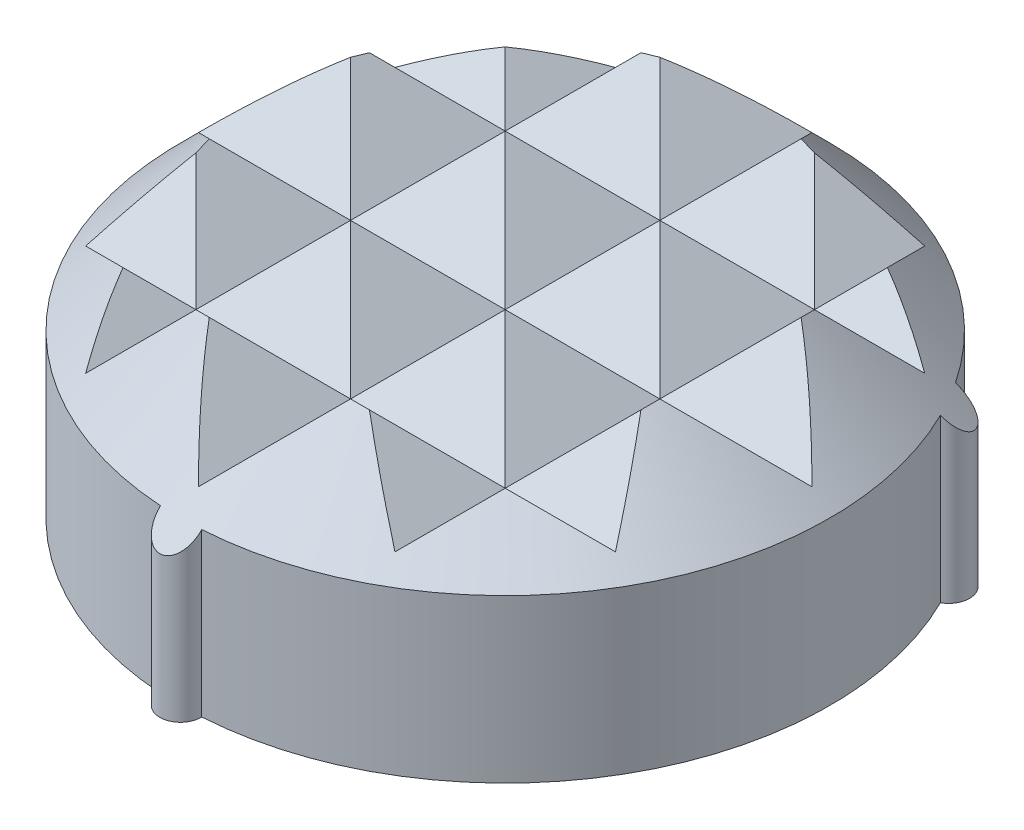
ISO-10303-21;
HEADER;
FILE_DESCRIPTION(('STEP AP214'),'2;1');
FILE_NAME('part.step','',(''),(''),'','','');
FILE_SCHEMA(('AUTOMOTIVE_DESIGN { 1 0 10303 214 1 1 1 1 }'));
ENDSEC;
DATA;
#1=APPLICATION_CONTEXT('core data for automotive mechanical design processes');
#2=APPLICATION_PROTOCOL_DEFINITION('international standard','automotive_design',2000,#1);
#3=PRODUCT_CONTEXT('',#1,'mechanical');
#4=PRODUCT('Part','Part','',(#3));
#5=PRODUCT_RELATED_PRODUCT_CATEGORY('part','',(#4));
#6=PRODUCT_DEFINITION_FORMATION('','',#4);
#7=PRODUCT_DEFINITION_CONTEXT('part definition',#1,'design');
#8=PRODUCT_DEFINITION('design','',#6,#7);
#9=PRODUCT_DEFINITION_SHAPE('','',#8);
#10=(LENGTH_UNIT() NAMED_UNIT(*) SI_UNIT(.MILLI.,.METRE.));
#11=(NAMED_UNIT(*) PLANE_ANGLE_UNIT() SI_UNIT($,.RADIAN.));
#12=(NAMED_UNIT(*) SI_UNIT($,.STERADIAN.) SOLID_ANGLE_UNIT());
#13=UNCERTAINTY_MEASURE_WITH_UNIT(LENGTH_MEASURE(1.E-05),#10,'distance_accuracy_value','');
#14=(GEOMETRIC_REPRESENTATION_CONTEXT(3) GLOBAL_UNCERTAINTY_ASSIGNED_CONTEXT((#13)) GLOBAL_UNIT_ASSIGNED_CONTEXT((#10,
#11,#12)) REPRESENTATION_CONTEXT('',''));
#15=CARTESIAN_POINT('',(0.,0.,0.));
#16=DIRECTION('',(0.,0.,1.));
#17=DIRECTION('',(1.,0.,0.));
#18=AXIS2_PLACEMENT_3D('',#15,#16,#17);
#19=CARTESIAN_POINT('',(0.,1.,0.));
#20=DIRECTION('',(0.,-1.,0.));
#21=DIRECTION('',(0.,0.,-1.));
#22=AXIS2_PLACEMENT_3D('',#19,#20,#21);
#23=CONICAL_SURFACE('',#22,8.45000000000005,0.785398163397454);
#24=CARTESIAN_POINT('',(-0.399791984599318,3.15020000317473,6.28710158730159));
#25=CARTESIAN_POINT('',(-0.400276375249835,3.13501121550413,6.30228975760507));
#26=CARTESIAN_POINT('',(-0.399906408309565,3.11984579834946,6.31750988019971));
#27=CARTESIAN_POINT('',(-0.397410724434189,3.0896197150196,6.34795303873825));
#28=CARTESIAN_POINT('',(-0.39528246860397,3.07455923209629,6.36317604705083));
#29=CARTESIAN_POINT('',(-0.386139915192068,3.0294362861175,6.40894719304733));
#30=CARTESIAN_POINT('',(-0.376357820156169,2.9996915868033,6.43933811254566));
#31=CARTESIAN_POINT('',(-0.352934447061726,2.95078014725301,6.48963860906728));
#32=CARTESIAN_POINT('',(-0.341294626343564,2.93108995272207,6.50998631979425));
#33=CARTESIAN_POINT('',(-0.313802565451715,2.8933077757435,6.54919521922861));
#34=CARTESIAN_POINT('',(-0.297965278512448,2.87521041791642,6.56806138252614));
#35=CARTESIAN_POINT('',(-0.26624140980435,2.84551381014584,6.59913280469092));
#36=CARTESIAN_POINT('',(-0.251318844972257,2.83340921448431,6.61183711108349));
#37=CARTESIAN_POINT('',(-0.218868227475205,2.81100571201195,6.63540636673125));
#38=CARTESIAN_POINT('',(-0.20134289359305,2.80070494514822,6.64627321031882));
#39=CARTESIAN_POINT('',(-0.167491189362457,2.78427189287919,6.66364103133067));
#40=CARTESIAN_POINT('',(-0.151595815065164,2.77771848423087,6.67058010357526));
#41=CARTESIAN_POINT('',(-0.118441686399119,2.76650434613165,6.68246687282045));
#42=CARTESIAN_POINT('',(-0.101183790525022,2.76184243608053,6.68741581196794));
#43=CARTESIAN_POINT('',(-0.0655994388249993,2.75469683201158,6.6950056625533));
#44=CARTESIAN_POINT('',(-0.0472667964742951,2.75222741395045,6.69763144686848));
#45=CARTESIAN_POINT('',(-0.0102507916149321,2.74971947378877,6.70029820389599));
#46=CARTESIAN_POINT('',(0.00843240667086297,2.74967984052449,6.70034035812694));
#47=CARTESIAN_POINT('',(0.0434913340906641,2.75190417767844,6.69797514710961));
#48=CARTESIAN_POINT('',(0.0599015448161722,2.75392415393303,6.69582723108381));
#49=CARTESIAN_POINT('',(0.0920168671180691,2.75977071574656,6.68961582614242));
#50=CARTESIAN_POINT('',(0.107721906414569,2.76359748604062,6.68555214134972));
#51=CARTESIAN_POINT('',(0.138576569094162,2.77299046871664,6.67558998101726));
#52=CARTESIAN_POINT('',(0.153692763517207,2.77860801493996,6.66963738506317));
#53=CARTESIAN_POINT('',(0.182603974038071,2.79126732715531,6.65624449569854));
#54=CARTESIAN_POINT('',(0.196398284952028,2.79830984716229,6.64880341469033));
#55=CARTESIAN_POINT('',(0.228953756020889,2.81728782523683,6.62878912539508));
#56=CARTESIAN_POINT('',(0.246853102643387,2.82993376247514,6.6154836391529));
#57=CARTESIAN_POINT('',(0.279464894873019,2.85709355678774,6.58700235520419));
#58=CARTESIAN_POINT('',(0.294170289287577,2.87161143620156,6.57182253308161));
#59=CARTESIAN_POINT('',(0.325248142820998,2.90742524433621,6.53451278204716));
#60=CARTESIAN_POINT('',(0.340323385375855,2.9292832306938,6.51184435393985));
#61=CARTESIAN_POINT('',(0.365263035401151,2.9745239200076,6.46518059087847));
#62=CARTESIAN_POINT('',(0.375116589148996,2.9979096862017,6.44118260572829));
#63=CARTESIAN_POINT('',(0.38909925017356,3.04275509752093,6.39542430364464));
#64=CARTESIAN_POINT('',(0.393762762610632,3.06412045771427,6.3737302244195));
#65=CARTESIAN_POINT('',(0.399436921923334,3.10705319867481,6.33035787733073));
#66=CARTESIAN_POINT('',(0.400472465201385,3.12861818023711,6.30868052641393));
#67=CARTESIAN_POINT('',(0.399791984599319,3.15020000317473,6.28710158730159));
#68=B_SPLINE_CURVE_WITH_KNOTS('',3,(#24,#25,#26,#27,#28,#29,#30,#31,#32,#33,#34,#35,#36,#37,#38,
#39,#40,#41,#42,#43,#44,#45,#46,#47,#48,#49,#50,#51,#52,#53,#54,#55,#56,#57,#58,#59,#60,#61,#62,
#63,#64,#65,#66,#67),.UNSPECIFIED.,.F.,.F.,(4,2,2,2,2,2,2,2,2,2,2,2,2,2,2,2,2,2,2,2,2,4),(0.,
0.06440994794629,0.128913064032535,0.259007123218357,0.350565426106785,0.441801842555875,
0.510670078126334,0.579466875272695,0.634867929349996,0.690234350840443,0.745958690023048,
0.801657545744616,0.851446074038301,0.901239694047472,0.952613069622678,1.00401370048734,
1.08050149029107,1.15715646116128,1.26133441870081,1.36572807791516,1.45792201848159,
1.54948203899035),.UNSPECIFIED.);
#69=CARTESIAN_POINT('',(-0.399798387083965,3.15000000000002,6.28730158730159));
#70=VERTEX_POINT('',#69);
#71=CARTESIAN_POINT('',(0.399798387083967,3.15000000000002,6.28730158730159));
#72=VERTEX_POINT('',#71);
#73=EDGE_CURVE('E528',#70,#72,#68,.T.);
#74=ORIENTED_EDGE('',*,*,#73,.T.);
#75=CARTESIAN_POINT('',(0.,3.15000000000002,0.));
#76=DIRECTION('',(0.,-1.,0.));
#77=DIRECTION('',(0.,0.,-1.));
#78=AXIS2_PLACEMENT_3D('',#75,#76,#77);
#79=CIRCLE('',#78,6.3);
#80=CARTESIAN_POINT('',(5.64486208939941,3.15000000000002,-2.79741523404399));
#81=VERTEX_POINT('',#80);
#82=EDGE_CURVE('E625',#72,#81,#79,.F.);
#83=ORIENTED_EDGE('',*,*,#82,.T.);
#84=CARTESIAN_POINT('',(5.64448831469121,3.15042371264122,-2.79721523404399));
#85=CARTESIAN_POINT('',(5.65789012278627,3.13523209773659,-2.80438353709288));
#86=CARTESIAN_POINT('',(5.67089250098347,3.12006362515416,-2.81230807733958));
#87=CARTESIAN_POINT('',(5.6960220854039,3.08983101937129,-2.82967975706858));
#88=CARTESIAN_POINT('',(5.70814800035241,3.07476706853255,-2.83912907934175));
#89=CARTESIAN_POINT('',(5.74323567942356,3.02963313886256,-2.8699170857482));
#90=CARTESIAN_POINT('',(5.7646777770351,2.99988027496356,-2.89357496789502));
#91=CARTESIAN_POINT('',(5.79655599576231,2.95094779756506,-2.93900174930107));
#92=CARTESIAN_POINT('',(5.80837116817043,2.93124552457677,-2.95925664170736));
#93=CARTESIAN_POINT('',(5.82860696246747,2.89343888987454,-3.00267405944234));
#94=CARTESIAN_POINT('',(5.8370393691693,2.87532915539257,-3.02582611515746));
#95=CARTESIAN_POINT('',(5.84810594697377,2.84561257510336,-3.06884187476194));
#96=CARTESIAN_POINT('',(5.85165497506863,2.83350019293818,-3.088119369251));
#97=CARTESIAN_POINT('',(5.85585682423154,2.81108090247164,-3.12801269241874));
#98=CARTESIAN_POINT('',(5.85651264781,2.80077213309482,-3.14862711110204));
#99=CARTESIAN_POINT('',(5.8546405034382,2.78432543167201,-3.18663394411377));
#100=CARTESIAN_POINT('',(5.85270783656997,2.77776620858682,-3.20387177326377));
#101=CARTESIAN_POINT('',(5.84643565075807,2.76654037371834,-3.2385337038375));
#102=CARTESIAN_POINT('',(5.84209763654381,2.76187258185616,-3.2559576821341));
#103=CARTESIAN_POINT('',(5.83088746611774,2.75471543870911,-3.29057842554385));
#104=CARTESIAN_POINT('',(5.82399908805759,2.75224038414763,-3.30777298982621));
#105=CARTESIAN_POINT('',(5.80780694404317,2.74972200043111,-3.34117432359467));
#106=CARTESIAN_POINT('',(5.79850428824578,2.74967755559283,-3.35738154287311));
#107=CARTESIAN_POINT('',(5.77893092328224,2.75189378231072,-3.38657042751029));
#108=CARTESIAN_POINT('',(5.76886808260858,2.75391004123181,-3.39971184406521));
#109=CARTESIAN_POINT('',(5.74743511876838,2.75974974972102,-3.42442654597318));
#110=CARTESIAN_POINT('',(5.73606486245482,2.76357338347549,-3.43599967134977));
#111=CARTESIAN_POINT('',(5.71201434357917,2.77295986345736,-3.4577457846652));
#112=CARTESIAN_POINT('',(5.69930406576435,2.77857378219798,-3.46786306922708));
#113=CARTESIAN_POINT('',(5.6732551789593,2.79122607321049,-3.48620999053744));
#114=CARTESIAN_POINT('',(5.65991624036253,2.79826519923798,-3.49443862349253));
#115=CARTESIAN_POINT('',(5.62631374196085,2.81723348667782,-3.51263143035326));
#116=CARTESIAN_POINT('',(5.60584672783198,2.8298729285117,-3.521483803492));
#117=CARTESIAN_POINT('',(5.56488551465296,2.85701983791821,-3.53549458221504));
#118=CARTESIAN_POINT('',(5.54439135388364,2.8715313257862,-3.54064487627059));
#119=CARTESIAN_POINT('',(5.49655114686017,2.90733031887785,-3.54891692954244));
#120=CARTESIAN_POINT('',(5.46938697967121,2.92917997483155,-3.55064637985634));
#121=CARTESIAN_POINT('',(5.41651326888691,2.97440458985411,-3.54893036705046));
#122=CARTESIAN_POINT('',(5.3908068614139,2.99778262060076,-3.54547415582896));
#123=CARTESIAN_POINT('',(5.34415753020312,3.04264745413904,-3.53471501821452));
#124=CARTESIAN_POINT('',(5.32300730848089,3.0640409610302,-3.52790231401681));
#125=CARTESIAN_POINT('',(5.28255180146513,3.10703077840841,-3.51111258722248));
#126=CARTESIAN_POINT('',(5.26323481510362,3.12862467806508,-3.50115767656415));
#127=CARTESIAN_POINT('',(5.24486370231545,3.15023529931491,-3.48976217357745));
#128=B_SPLINE_CURVE_WITH_KNOTS('',3,(#84,#85,#86,#87,#88,#89,#90,#91,#92,#93,#94,#95,#96,#97,
#98,#99,#100,#101,#102,#103,#104,#105,#106,#107,#108,#109,#110,#111,#112,#113,#114,#115,#116,
#117,#118,#119,#120,#121,#122,#123,#124,#125,#126,#127),.UNSPECIFIED.,.F.,.F.,(4,2,2,2,2,2,2,2,
2,2,2,2,2,2,2,2,2,2,2,2,2,4),(0.,0.0644213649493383,0.12893578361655,0.259052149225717,
0.35065045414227,0.441926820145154,0.51081609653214,0.579633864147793,0.635046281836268,
0.690424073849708,0.746160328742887,0.801870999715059,0.851662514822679,0.901459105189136,
0.95282699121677,1.00422211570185,1.08069108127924,1.1573270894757,1.26147930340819,
1.36584768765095,1.45816557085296,1.54984777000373),.UNSPECIFIED.);
#129=CARTESIAN_POINT('',(5.24506370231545,3.15000000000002,-3.4898863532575));
#130=VERTEX_POINT('',#129);
#131=EDGE_CURVE('E498',#81,#130,#128,.T.);
#132=ORIENTED_EDGE('',*,*,#131,.T.);
#133=CARTESIAN_POINT('',(0.,3.15000000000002,0.));
#134=DIRECTION('',(0.,-1.,0.));
#135=DIRECTION('',(0.,0.,-1.));
#136=AXIS2_PLACEMENT_3D('',#133,#134,#135);
#137=CIRCLE('',#136,6.3);
#138=CARTESIAN_POINT('',(-5.2450637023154,3.15000000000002,-3.48988635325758));
#139=VERTEX_POINT('',#138);
#140=EDGE_CURVE('E578',#130,#139,#137,.F.);
#141=ORIENTED_EDGE('',*,*,#140,.T.);
#142=CARTESIAN_POINT('',(-5.2448637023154,3.15023529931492,-3.48976217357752));
#143=CARTESIAN_POINT('',(-5.25777448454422,3.13504606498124,-3.49777710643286));
#144=CARTESIAN_POINT('',(-5.27114017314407,3.11988016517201,-3.50506810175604));
#145=CARTESIAN_POINT('',(-5.29875204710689,3.0896530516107,-3.51813100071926));
#146=CARTESIAN_POINT('',(-5.31299947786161,3.07459202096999,-3.52390069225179));
#147=CARTESIAN_POINT('',(-5.3572092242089,3.02946734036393,-3.53887251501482));
#148=CARTESIAN_POINT('',(-5.38841942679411,2.99972135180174,-3.54559904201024));
#149=CARTESIAN_POINT('',(-5.44369367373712,2.95080659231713,-3.55046861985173));
#150=CARTESIAN_POINT('',(-5.46713636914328,2.9311144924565,-3.55056387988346));
#151=CARTESIAN_POINT('',(-5.51484091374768,2.89332845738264,-3.5463627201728));
#152=CARTESIAN_POINT('',(-5.53909959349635,2.87522914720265,-3.5420817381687));
#153=CARTESIAN_POINT('',(-5.58187260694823,2.84552938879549,-3.53014598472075));
#154=CARTESIAN_POINT('',(-5.60033705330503,2.83342356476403,-3.52357575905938));
#155=CARTESIAN_POINT('',(-5.63697593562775,2.81101757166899,-3.50725901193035));
#156=CARTESIAN_POINT('',(-5.65515065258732,2.80071554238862,-3.49751579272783));
#157=CARTESIAN_POINT('',(-5.68711936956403,2.78428033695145,-3.47688449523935));
#158=CARTESIAN_POINT('',(-5.70107725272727,2.77772601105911,-3.46658880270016));
#159=CARTESIAN_POINT('',(-5.72795025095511,2.76651002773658,-3.44382083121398));
#160=CARTESIAN_POINT('',(-5.74086601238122,2.76184718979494,-3.43134991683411));
#161=CARTESIAN_POINT('',(-5.76523311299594,2.75469976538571,-3.40432842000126));
#162=CARTESIAN_POINT('',(-5.77667444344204,2.75222945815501,-3.38976491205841));
#163=CARTESIAN_POINT('',(-5.79749395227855,2.74971987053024,-3.3590414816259));
#164=CARTESIAN_POINT('',(-5.80687307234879,2.74967947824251,-3.34288229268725));
#165=CARTESIAN_POINT('',(-5.82235585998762,2.75190253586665,-3.31133761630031));
#166=CARTESIAN_POINT('',(-5.82870151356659,2.7539219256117,-3.29605203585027));
#167=CARTESIAN_POINT('',(-5.83938130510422,2.75976740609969,-3.26513357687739));
#168=CARTESIAN_POINT('',(-5.84371523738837,2.76359368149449,-3.24950066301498));
#169=CARTESIAN_POINT('',(-5.8505162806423,2.77298563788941,-3.21779875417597));
#170=CARTESIAN_POINT('',(-5.85291986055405,2.7786026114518,-3.20173164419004));
#171=CARTESIAN_POINT('',(-5.85577805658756,2.79126081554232,-3.16999764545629));
#172=CARTESIAN_POINT('',(-5.85623163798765,2.79830280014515,-3.15433097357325));
#173=CARTESIAN_POINT('',(-5.8551779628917,2.81727925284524,-3.11613058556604));
#174=CARTESIAN_POINT('',(-5.85260570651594,2.82992416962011,-3.09397700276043));
#175=CARTESIAN_POINT('',(-5.84424809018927,2.85708193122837,-3.05149442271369));
#176=CARTESIAN_POINT('',(-5.83845572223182,2.87159879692,-3.03116951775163));
#177=CARTESIAN_POINT('',(-5.82168599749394,2.90741022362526,-2.9856008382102));
#178=CARTESIAN_POINT('',(-5.8095937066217,2.92926685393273,-2.9612111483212));
#179=CARTESIAN_POINT('',(-5.78165457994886,2.97450498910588,-2.91628062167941));
#180=CARTESIAN_POINT('',(-5.76580000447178,2.99788956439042,-2.8957478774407));
#181=CARTESIAN_POINT('',(-5.73313679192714,3.04277346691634,-2.86072677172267));
#182=CARTESIAN_POINT('',(-5.71664828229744,3.06417977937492,-2.84581464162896));
#183=CARTESIAN_POINT('',(-5.68185211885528,3.10719478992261,-2.81917380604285));
#184=CARTESIAN_POINT('',(-5.66355777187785,3.12880107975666,-2.80742388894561));
#185=CARTESIAN_POINT('',(-5.64448831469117,3.15042371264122,-2.79721523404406));
#186=B_SPLINE_CURVE_WITH_KNOTS('',3,(#142,#143,#144,#145,#146,#147,#148,#149,#150,#151,#152,
#153,#154,#155,#156,#157,#158,#159,#160,#161,#162,#163,#164,#165,#166,#167,#168,#169,#170,#171,
#172,#173,#174,#175,#176,#177,#178,#179,#180,#181,#182,#183,#184,#185),.UNSPECIFIED.,.F.,.F.,(4,
2,2,2,2,2,2,2,2,2,2,2,2,2,2,2,2,2,2,2,2,4),(0.,0.0644117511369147,0.128916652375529,
0.25901423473,0.350578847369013,0.441821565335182,0.510693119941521,0.579493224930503,
0.6348960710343,0.690264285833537,0.745990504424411,0.801691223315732,0.851480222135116,
0.901274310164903,0.952646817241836,1.00404658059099,1.08053142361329,1.15718337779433,
1.2613570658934,1.36574694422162,1.45811535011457,1.54984778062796),.UNSPECIFIED.);
#187=CARTESIAN_POINT('',(-5.64486208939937,3.15000000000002,-2.79741523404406));
#188=VERTEX_POINT('',#187);
#189=EDGE_CURVE('E492',#139,#188,#186,.T.);
#190=ORIENTED_EDGE('',*,*,#189,.T.);
#191=CARTESIAN_POINT('',(0.,3.15000000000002,0.));
#192=DIRECTION('',(0.,-1.,0.));
#193=DIRECTION('',(0.,0.,-1.));
#194=AXIS2_PLACEMENT_3D('',#191,#192,#193);
#195=CIRCLE('',#194,6.3);
#196=EDGE_CURVE('E536',#188,#70,#195,.F.);
#197=ORIENTED_EDGE('',*,*,#196,.T.);
#198=EDGE_LOOP('',(#74,#83,#132,#141,#190,#197));
#199=FACE_BOUND('',#198,.T.);
#200=CARTESIAN_POINT('',(1.4998,5.0002,4.18942955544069));
#201=CARTESIAN_POINT('',(1.62248228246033,4.87751771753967,4.27579277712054));
#202=CARTESIAN_POINT('',(1.74589628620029,4.75410371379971,4.36004843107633));
#203=CARTESIAN_POINT('',(1.99393055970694,4.50606944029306,4.52476764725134));
#204=CARTESIAN_POINT('',(2.11855038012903,4.38144961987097,4.60523256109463));
#205=CARTESIAN_POINT('',(2.36881175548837,4.13118824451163,4.76284478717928));
#206=CARTESIAN_POINT('',(2.49445317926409,4.00554682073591,4.83999251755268));
#207=CARTESIAN_POINT('',(2.74667205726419,3.75332794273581,4.99134908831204));
#208=CARTESIAN_POINT('',(2.87324983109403,3.62675016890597,5.06555686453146));
#209=CARTESIAN_POINT('',(3.0002,3.4998,5.13845112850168));
#210=B_SPLINE_CURVE_WITH_KNOTS('',3,(#200,#201,#202,#203,#204,#205,#206,#207,#208,#209),
.UNSPECIFIED.,.F.,.F.,(4,2,2,2,4),(0.,0.581383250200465,1.16255760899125,1.74365849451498,
2.3249678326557),.UNSPECIFIED.);
#211=CARTESIAN_POINT('',(1.6832951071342,4.81670489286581,4.31670489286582));
#212=VERTEX_POINT('',#211);
#213=CARTESIAN_POINT('',(3.,3.5,5.1383363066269));
#214=VERTEX_POINT('',#213);
#215=EDGE_CURVE('E653',#212,#214,#210,.T.);
#216=ORIENTED_EDGE('',*,*,#215,.F.);
#217=CARTESIAN_POINT('',(5.13868465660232,3.4998,2.99980000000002));
#218=CARTESIAN_POINT('',(5.02492067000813,3.56511317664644,3.06511317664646));
#219=CARTESIAN_POINT('',(4.90966625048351,3.62912291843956,3.12912291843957));
#220=CARTESIAN_POINT('',(4.67600517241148,3.75425427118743,3.25425427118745));
#221=CARTESIAN_POINT('',(4.55759746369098,3.81537490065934,3.31537490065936));
#222=CARTESIAN_POINT('',(4.1965048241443,3.99441129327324,3.49441129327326));
#223=CARTESIAN_POINT('',(3.94889517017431,4.1074526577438,3.60745265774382));
#224=CARTESIAN_POINT('',(3.43668635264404,4.31889366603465,3.81889366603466));
#225=CARTESIAN_POINT('',(3.17189706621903,4.41706474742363,3.91706474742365));
#226=CARTESIAN_POINT('',(2.62936482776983,4.59286154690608,4.09286154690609));
#227=CARTESIAN_POINT('',(2.35164777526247,4.67052642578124,4.17052642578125));
#228=CARTESIAN_POINT('',(1.89182113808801,4.77680053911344,4.27680053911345));
#229=CARTESIAN_POINT('',(1.71312475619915,4.81286652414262,4.31286652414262));
#230=CARTESIAN_POINT('',(1.35214625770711,4.87467854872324,4.37467854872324));
#231=CARTESIAN_POINT('',(1.16986398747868,4.90042414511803,4.40042414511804));
#232=CARTESIAN_POINT('',(0.804257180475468,4.9407168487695,4.44071684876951));
#233=CARTESIAN_POINT('',(0.620951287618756,4.95534812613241,4.45534812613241));
#234=CARTESIAN_POINT('',(0.253233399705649,4.97330553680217,4.47330553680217));
#235=CARTESIAN_POINT('',(0.0688214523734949,4.9766321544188,4.4766321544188));
#236=CARTESIAN_POINT('',(-0.29989319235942,4.97187638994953,4.47187638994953));
#237=CARTESIAN_POINT('',(-0.484195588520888,4.96378241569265,4.46378241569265));
#238=CARTESIAN_POINT('',(-0.851126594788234,4.9364107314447,4.43641073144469));
#239=CARTESIAN_POINT('',(-1.0337551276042,4.91713250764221,4.41713250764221));
#240=CARTESIAN_POINT('',(-1.39748900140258,4.86775726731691,4.36775726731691));
#241=CARTESIAN_POINT('',(-1.57857215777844,4.83757899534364,4.33757899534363));
#242=CARTESIAN_POINT('',(-1.93677111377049,4.7672355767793,4.26723557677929));
#243=CARTESIAN_POINT('',(-2.11388701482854,4.72707068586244,4.22707068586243));
#244=CARTESIAN_POINT('',(-2.55081813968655,4.61533501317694,4.11533501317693));
#245=CARTESIAN_POINT('',(-2.80774928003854,4.53809831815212,4.03809831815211));
#246=CARTESIAN_POINT('',(-3.3099636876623,4.36647118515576,3.86647118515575));
#247=CARTESIAN_POINT('',(-3.55523803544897,4.27206787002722,3.77206787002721));
#248=CARTESIAN_POINT('',(-3.91239640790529,4.12064585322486,3.62064585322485));
#249=CARTESIAN_POINT('',(-4.02886992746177,4.06893531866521,3.5689353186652));
#250=CARTESIAN_POINT('',(-4.25888083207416,3.96243862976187,3.46243862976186));
#251=CARTESIAN_POINT('',(-4.3724198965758,3.90765429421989,3.40765429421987));
#252=CARTESIAN_POINT('',(-4.59629404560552,3.79547895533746,3.29547895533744));
#253=CARTESIAN_POINT('',(-4.70663883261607,3.7380975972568,3.23809759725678));
#254=CARTESIAN_POINT('',(-4.92465641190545,3.62078932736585,3.12078932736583));
#255=CARTESIAN_POINT('',(-5.03232817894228,3.56086146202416,3.06086146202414));
#256=CARTESIAN_POINT('',(-5.13868465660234,3.4998,2.99979999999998));
#257=B_SPLINE_CURVE_WITH_KNOTS('',3,(#217,#218,#219,#220,#221,#222,#223,#224,#225,#226,#227,
#228,#229,#230,#231,#232,#233,#234,#235,#236,#237,#238,#239,#240,#241,#242,#243,#244,#245,#246,
#247,#248,#249,#250,#251,#252,#253,#254,#255,#256),.UNSPECIFIED.,.F.,.F.,(4,2,2,2,2,2,2,2,2,2,2,
2,2,2,2,2,2,2,2,4),(0.,0.439581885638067,0.879312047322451,1.76243198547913,2.6579861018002,
3.55181739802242,4.10878766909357,4.6657818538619,5.21851460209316,5.77122367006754,
6.32449415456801,6.8777900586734,7.43529869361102,7.99279305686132,8.82876729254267,
9.66537122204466,10.0778759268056,10.4901390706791,10.9009798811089,11.3119759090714),.UNSPECIFIED.);
#258=CARTESIAN_POINT('',(1.37012596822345,4.87012596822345,4.37012596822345));
#259=VERTEX_POINT('',#258);
#260=EDGE_CURVE('E242',#212,#259,#257,.T.);
#261=ORIENTED_EDGE('',*,*,#260,.T.);
#262=CARTESIAN_POINT('',(-0.000200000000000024,3.4998,5.95019999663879));
#263=CARTESIAN_POINT('',(0.132670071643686,3.63267007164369,5.81728260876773));
#264=CARTESIAN_POINT('',(0.264113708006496,3.7641137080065,5.68143927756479));
#265=CARTESIAN_POINT('',(0.523182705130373,4.02318270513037,5.40334059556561));
#266=CARTESIAN_POINT('',(0.650814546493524,4.15081454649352,5.26109729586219));
#267=CARTESIAN_POINT('',(0.901864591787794,4.40186459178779,4.96906577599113));
#268=CARTESIAN_POINT('',(1.02527992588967,4.52527992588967,4.81927258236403));
#269=CARTESIAN_POINT('',(1.20649423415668,4.70649423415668,4.58815475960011));
#270=CARTESIAN_POINT('',(1.26630078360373,4.76630078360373,4.50996923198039));
#271=CARTESIAN_POINT('',(1.38441605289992,4.88441605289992,4.35134778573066));
#272=CARTESIAN_POINT('',(1.44272458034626,4.94272458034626,4.27091158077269));
#273=CARTESIAN_POINT('',(1.5002,5.0002,4.18928633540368));
#274=B_SPLINE_CURVE_WITH_KNOTS('',3,(#262,#263,#264,#265,#266,#267,#268,#269,#270,#271,#272,
#273),.UNSPECIFIED.,.F.,.F.,(4,2,2,2,2,4),(0.,0.690528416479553,1.37980694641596,
2.06954562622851,2.41505142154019,2.76060137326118),.UNSPECIFIED.);
#275=CARTESIAN_POINT('',(0.,3.5,5.95000000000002));
#276=VERTEX_POINT('',#275);
#277=EDGE_CURVE('E457',#276,#259,#274,.T.);
#278=ORIENTED_EDGE('',*,*,#277,.F.);
#279=CARTESIAN_POINT('',(-1.5002,5.0002,4.18928633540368));
#280=CARTESIAN_POINT('',(-1.44272458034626,4.94272458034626,4.27091158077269));
#281=CARTESIAN_POINT('',(-1.38441605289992,4.88441605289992,4.35134778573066));
#282=CARTESIAN_POINT('',(-1.26630078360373,4.76630078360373,4.50996923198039));
#283=CARTESIAN_POINT('',(-1.20649423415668,4.70649423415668,4.58815475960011));
#284=CARTESIAN_POINT('',(-1.02527992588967,4.52527992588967,4.81927258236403));
#285=CARTESIAN_POINT('',(-0.901864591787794,4.40186459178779,4.96906577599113));
#286=CARTESIAN_POINT('',(-0.650814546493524,4.15081454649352,5.26109729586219));
#287=CARTESIAN_POINT('',(-0.523182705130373,4.02318270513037,5.40334059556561));
#288=CARTESIAN_POINT('',(-0.264113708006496,3.7641137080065,5.6814392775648));
#289=CARTESIAN_POINT('',(-0.132670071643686,3.63267007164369,5.81728260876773));
#290=CARTESIAN_POINT('',(0.000200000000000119,3.4998,5.95019999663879));
#291=B_SPLINE_CURVE_WITH_KNOTS('',3,(#279,#280,#281,#282,#283,#284,#285,#286,#287,#288,#289,
#290),.UNSPECIFIED.,.F.,.F.,(4,2,2,2,2,4),(0.,0.345549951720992,0.691055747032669,
1.38079442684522,2.07007295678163,2.76060137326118),.UNSPECIFIED.);
#292=CARTESIAN_POINT('',(-1.37012596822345,4.87012596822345,4.37012596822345));
#293=VERTEX_POINT('',#292);
#294=EDGE_CURVE('E441',#293,#276,#291,.T.);
#295=ORIENTED_EDGE('',*,*,#294,.F.);
#296=CARTESIAN_POINT('',(-1.68329510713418,4.81670489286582,4.31670489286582));
#297=VERTEX_POINT('',#296);
#298=EDGE_CURVE('E654',#293,#297,#257,.T.);
#299=ORIENTED_EDGE('',*,*,#298,.T.);
#300=CARTESIAN_POINT('',(-3.0002,3.4998,5.13845112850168));
#301=CARTESIAN_POINT('',(-2.87324983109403,3.62675016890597,5.06555686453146));
#302=CARTESIAN_POINT('',(-2.74667205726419,3.75332794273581,4.99134908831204));
#303=CARTESIAN_POINT('',(-2.49445317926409,4.00554682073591,4.83999251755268));
#304=CARTESIAN_POINT('',(-2.36881175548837,4.13118824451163,4.76284478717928));
#305=CARTESIAN_POINT('',(-2.11855038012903,4.38144961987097,4.60523256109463));
#306=CARTESIAN_POINT('',(-1.99393055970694,4.50606944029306,4.52476764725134));
#307=CARTESIAN_POINT('',(-1.74589628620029,4.75410371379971,4.36004843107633));
#308=CARTESIAN_POINT('',(-1.62248228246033,4.87751771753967,4.27579277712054));
#309=CARTESIAN_POINT('',(-1.4998,5.0002,4.18942955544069));
#310=B_SPLINE_CURVE_WITH_KNOTS('',3,(#300,#301,#302,#303,#304,#305,#306,#307,#308,#309),
.UNSPECIFIED.,.F.,.F.,(4,2,2,2,4),(0.,0.58130933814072,1.16241022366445,1.74358458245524,
2.3249678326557),.UNSPECIFIED.);
#311=CARTESIAN_POINT('',(-3.,3.5,5.1383363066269));
#312=VERTEX_POINT('',#311);
#313=EDGE_CURVE('E1230',#312,#297,#310,.T.);
#314=ORIENTED_EDGE('',*,*,#313,.F.);
#315=CARTESIAN_POINT('',(-2.9998,3.4998,-5.13868465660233));
#316=CARTESIAN_POINT('',(-3.06511317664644,3.56511317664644,-5.02492067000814));
#317=CARTESIAN_POINT('',(-3.12912291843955,3.62912291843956,-4.90966625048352));
#318=CARTESIAN_POINT('',(-3.25425427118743,3.75425427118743,-4.67600517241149));
#319=CARTESIAN_POINT('',(-3.31537490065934,3.81537490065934,-4.55759746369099));
#320=CARTESIAN_POINT('',(-3.49441129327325,3.99441129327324,-4.19650482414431));
#321=CARTESIAN_POINT('',(-3.60745265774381,4.1074526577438,-3.94889517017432));
#322=CARTESIAN_POINT('',(-3.81889366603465,4.31889366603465,-3.43668635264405));
#323=CARTESIAN_POINT('',(-3.91706474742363,4.41706474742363,-3.17189706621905));
#324=CARTESIAN_POINT('',(-4.09286154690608,4.59286154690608,-2.62936482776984));
#325=CARTESIAN_POINT('',(-4.17052642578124,4.67052642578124,-2.35164777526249));
#326=CARTESIAN_POINT('',(-4.27680053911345,4.77680053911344,-1.89182113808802));
#327=CARTESIAN_POINT('',(-4.31286652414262,4.81286652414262,-1.71312475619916));
#328=CARTESIAN_POINT('',(-4.37467854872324,4.87467854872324,-1.35214625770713));
#329=CARTESIAN_POINT('',(-4.40042414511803,4.90042414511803,-1.1698639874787));
#330=CARTESIAN_POINT('',(-4.4407168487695,4.9407168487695,-0.804257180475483));
#331=CARTESIAN_POINT('',(-4.45534812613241,4.95534812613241,-0.620951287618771));
#332=CARTESIAN_POINT('',(-4.47330553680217,4.97330553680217,-0.253233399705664));
#333=CARTESIAN_POINT('',(-4.4766321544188,4.9766321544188,-0.0688214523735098));
#334=CARTESIAN_POINT('',(-4.47187638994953,4.97187638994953,0.299893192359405));
#335=CARTESIAN_POINT('',(-4.46378241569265,4.96378241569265,0.484195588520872));
#336=CARTESIAN_POINT('',(-4.4364107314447,4.9364107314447,0.851126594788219));
#337=CARTESIAN_POINT('',(-4.41713250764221,4.91713250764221,1.03375512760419));
#338=CARTESIAN_POINT('',(-4.36775726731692,4.86775726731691,1.39748900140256));
#339=CARTESIAN_POINT('',(-4.33757899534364,4.83757899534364,1.57857215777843));
#340=CARTESIAN_POINT('',(-4.2672355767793,4.7672355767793,1.93677111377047));
#341=CARTESIAN_POINT('',(-4.22707068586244,4.72707068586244,2.11388701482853));
#342=CARTESIAN_POINT('',(-4.11533501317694,4.61533501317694,2.55081813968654));
#343=CARTESIAN_POINT('',(-4.03809831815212,4.53809831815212,2.80774928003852));
#344=CARTESIAN_POINT('',(-3.86647118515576,4.36647118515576,3.30996368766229));
#345=CARTESIAN_POINT('',(-3.77206787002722,4.27206787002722,3.55523803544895));
#346=CARTESIAN_POINT('',(-3.62064585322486,4.12064585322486,3.91239640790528));
#347=CARTESIAN_POINT('',(-3.56893531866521,4.06893531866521,4.02886992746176));
#348=CARTESIAN_POINT('',(-3.46243862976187,3.96243862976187,4.25888083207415));
#349=CARTESIAN_POINT('',(-3.40765429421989,3.90765429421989,4.37241989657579));
#350=CARTESIAN_POINT('',(-3.29547895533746,3.79547895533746,4.59629404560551));
#351=CARTESIAN_POINT('',(-3.2380975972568,3.7380975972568,4.70663883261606));
#352=CARTESIAN_POINT('',(-3.12078932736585,3.62078932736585,4.92465641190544));
#353=CARTESIAN_POINT('',(-3.06086146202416,3.56086146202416,5.03232817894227));
#354=CARTESIAN_POINT('',(-2.9998,3.4998,5.13868465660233));
#355=B_SPLINE_CURVE_WITH_KNOTS('',3,(#315,#316,#317,#318,#319,#320,#321,#322,#323,#324,#325,
#326,#327,#328,#329,#330,#331,#332,#333,#334,#335,#336,#337,#338,#339,#340,#341,#342,#343,#344,
#345,#346,#347,#348,#349,#350,#351,#352,#353,#354),.UNSPECIFIED.,.F.,.F.,(4,2,2,2,2,2,2,2,2,2,2,
2,2,2,2,2,2,2,2,4),(0.,0.439581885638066,0.879312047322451,1.76243198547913,2.6579861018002,
3.55181739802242,4.10878766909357,4.6657818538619,5.21851460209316,5.77122367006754,
6.32449415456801,6.8777900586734,7.43529869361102,7.99279305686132,8.82876729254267,
9.66537122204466,10.0778759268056,10.4901390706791,10.9009798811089,11.3119759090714),.UNSPECIFIED.);
#356=CARTESIAN_POINT('',(-3.70721138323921,4.20721138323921,3.7072113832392));
#357=VERTEX_POINT('',#356);
#358=EDGE_CURVE('E588',#357,#312,#355,.T.);
#359=ORIENTED_EDGE('',*,*,#358,.F.);
#360=CARTESIAN_POINT('',(-5.13833630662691,3.5,2.99999999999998));
#361=VERTEX_POINT('',#360);
#362=EDGE_CURVE('E243',#357,#361,#257,.T.);
#363=ORIENTED_EDGE('',*,*,#362,.T.);
#364=CARTESIAN_POINT('',(-5.13845112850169,3.4998,3.00019999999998));
#365=CARTESIAN_POINT('',(-5.06555686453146,3.62675016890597,2.87324983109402));
#366=CARTESIAN_POINT('',(-4.99134908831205,3.75332794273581,2.74667205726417));
#367=CARTESIAN_POINT('',(-4.83999251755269,4.00554682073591,2.49445317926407));
#368=CARTESIAN_POINT('',(-4.76284478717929,4.13118824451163,2.36881175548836));
#369=CARTESIAN_POINT('',(-4.60523256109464,4.38144961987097,2.11855038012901));
#370=CARTESIAN_POINT('',(-4.52476764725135,4.50606944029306,1.99393055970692));
#371=CARTESIAN_POINT('',(-4.36004843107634,4.75410371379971,1.74589628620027));
#372=CARTESIAN_POINT('',(-4.27579277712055,4.87751771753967,1.62248228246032));
#373=CARTESIAN_POINT('',(-4.1894295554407,5.0002,1.49979999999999));
#374=B_SPLINE_CURVE_WITH_KNOTS('',3,(#364,#365,#366,#367,#368,#369,#370,#371,#372,#373),
.UNSPECIFIED.,.F.,.F.,(4,2,2,2,4),(0.,0.581309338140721,1.16241022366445,1.74358458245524,
2.3249678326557),.UNSPECIFIED.);
#375=CARTESIAN_POINT('',(-4.31670489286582,4.81670489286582,1.68329510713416));
#376=VERTEX_POINT('',#375);
#377=EDGE_CURVE('E291',#361,#376,#374,.T.);
#378=ORIENTED_EDGE('',*,*,#377,.T.);
#379=CARTESIAN_POINT('',(-4.37012596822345,4.87012596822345,1.37012596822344));
#380=VERTEX_POINT('',#379);
#381=EDGE_CURVE('E1272',#380,#376,#355,.T.);
#382=ORIENTED_EDGE('',*,*,#381,.F.);
#383=CARTESIAN_POINT('',(-4.18928633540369,5.0002,1.50019999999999));
#384=CARTESIAN_POINT('',(-4.27091158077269,4.94272458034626,1.44272458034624));
#385=CARTESIAN_POINT('',(-4.35134778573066,4.88441605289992,1.3844160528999));
#386=CARTESIAN_POINT('',(-4.5099692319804,4.76630078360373,1.26630078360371));
#387=CARTESIAN_POINT('',(-4.58815475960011,4.70649423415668,1.20649423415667));
#388=CARTESIAN_POINT('',(-4.81927258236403,4.52527992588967,1.02527992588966));
#389=CARTESIAN_POINT('',(-4.96906577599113,4.40186459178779,0.901864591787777));
#390=CARTESIAN_POINT('',(-5.26109729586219,4.15081454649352,0.650814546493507));
#391=CARTESIAN_POINT('',(-5.40334059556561,4.02318270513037,0.523182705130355));
#392=CARTESIAN_POINT('',(-5.6814392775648,3.7641137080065,0.264113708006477));
#393=CARTESIAN_POINT('',(-5.81728260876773,3.63267007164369,0.132670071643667));
#394=CARTESIAN_POINT('',(-5.95019999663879,3.4998,-0.000200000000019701));
#395=B_SPLINE_CURVE_WITH_KNOTS('',3,(#383,#384,#385,#386,#387,#388,#389,#390,#391,#392,#393,
#394),.UNSPECIFIED.,.F.,.F.,(4,2,2,2,2,4),(0.,0.345549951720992,0.691055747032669,
1.38079442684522,2.07007295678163,2.76060137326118),.UNSPECIFIED.);
#396=CARTESIAN_POINT('',(-5.95000000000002,3.5,0.));
#397=VERTEX_POINT('',#396);
#398=EDGE_CURVE('E332',#380,#397,#395,.T.);
#399=ORIENTED_EDGE('',*,*,#398,.T.);
#400=CARTESIAN_POINT('',(-5.95019999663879,3.4998,0.000199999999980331));
#401=CARTESIAN_POINT('',(-5.81728260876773,3.63267007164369,-0.132670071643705));
#402=CARTESIAN_POINT('',(-5.68143927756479,3.7641137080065,-0.264113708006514));
#403=CARTESIAN_POINT('',(-5.40334059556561,4.02318270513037,-0.523182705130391));
#404=CARTESIAN_POINT('',(-5.26109729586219,4.15081454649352,-0.650814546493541));
#405=CARTESIAN_POINT('',(-4.96906577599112,4.40186459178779,-0.90186459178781));
#406=CARTESIAN_POINT('',(-4.81927258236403,4.52527992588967,-1.02527992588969));
#407=CARTESIAN_POINT('',(-4.5881547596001,4.70649423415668,-1.2064942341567));
#408=CARTESIAN_POINT('',(-4.50996923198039,4.76630078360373,-1.26630078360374));
#409=CARTESIAN_POINT('',(-4.35134778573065,4.88441605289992,-1.38441605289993));
#410=CARTESIAN_POINT('',(-4.27091158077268,4.94272458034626,-1.44272458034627));
#411=CARTESIAN_POINT('',(-4.18928633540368,5.0002,-1.50020000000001));
#412=B_SPLINE_CURVE_WITH_KNOTS('',3,(#400,#401,#402,#403,#404,#405,#406,#407,#408,#409,#410,
#411),.UNSPECIFIED.,.F.,.F.,(4,2,2,2,2,4),(0.,0.690528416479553,1.37980694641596,
2.06954562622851,2.41505142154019,2.76060137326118),.UNSPECIFIED.);
#413=CARTESIAN_POINT('',(-4.37012596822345,4.87012596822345,-1.37012596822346));
#414=VERTEX_POINT('',#413);
#415=EDGE_CURVE('E385',#397,#414,#412,.T.);
#416=ORIENTED_EDGE('',*,*,#415,.T.);
#417=CARTESIAN_POINT('',(-4.31670489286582,4.81670489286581,-1.6832951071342));
#418=VERTEX_POINT('',#417);
#419=EDGE_CURVE('E1271',#418,#414,#355,.T.);
#420=ORIENTED_EDGE('',*,*,#419,.F.);
#421=CARTESIAN_POINT('',(-4.18942955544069,5.0002,-1.49980000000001));
#422=CARTESIAN_POINT('',(-4.27579277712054,4.87751771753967,-1.62248228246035));
#423=CARTESIAN_POINT('',(-4.36004843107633,4.75410371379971,-1.7458962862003));
#424=CARTESIAN_POINT('',(-4.52476764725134,4.50606944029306,-1.99393055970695));
#425=CARTESIAN_POINT('',(-4.60523256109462,4.38144961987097,-2.11855038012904));
#426=CARTESIAN_POINT('',(-4.76284478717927,4.13118824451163,-2.36881175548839));
#427=CARTESIAN_POINT('',(-4.83999251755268,4.00554682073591,-2.4944531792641));
#428=CARTESIAN_POINT('',(-4.99134908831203,3.75332794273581,-2.74667205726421));
#429=CARTESIAN_POINT('',(-5.06555686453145,3.62675016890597,-2.87324983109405));
#430=CARTESIAN_POINT('',(-5.13845112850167,3.4998,-3.00020000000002));
#431=B_SPLINE_CURVE_WITH_KNOTS('',3,(#421,#422,#423,#424,#425,#426,#427,#428,#429,#430),
.UNSPECIFIED.,.F.,.F.,(4,2,2,2,4),(0.,0.581383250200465,1.16255760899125,1.74365849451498,
2.3249678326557),.UNSPECIFIED.);
#432=CARTESIAN_POINT('',(-5.13833630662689,3.5,-3.00000000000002));
#433=VERTEX_POINT('',#432);
#434=EDGE_CURVE('E692',#418,#433,#431,.T.);
#435=ORIENTED_EDGE('',*,*,#434,.T.);
#436=CARTESIAN_POINT('',(-5.13868465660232,3.4998,-2.99980000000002));
#437=CARTESIAN_POINT('',(-5.02492067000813,3.56511317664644,-3.06511317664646));
#438=CARTESIAN_POINT('',(-4.90966625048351,3.62912291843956,-3.12912291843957));
#439=CARTESIAN_POINT('',(-4.67600517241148,3.75425427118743,-3.25425427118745));
#440=CARTESIAN_POINT('',(-4.55759746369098,3.81537490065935,-3.31537490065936));
#441=CARTESIAN_POINT('',(-4.1965048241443,3.99441129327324,-3.49441129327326));
#442=CARTESIAN_POINT('',(-3.94889517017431,4.10745265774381,-3.60745265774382));
#443=CARTESIAN_POINT('',(-3.43668635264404,4.31889366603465,-3.81889366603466));
#444=CARTESIAN_POINT('',(-3.17189706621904,4.41706474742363,-3.91706474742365));
#445=CARTESIAN_POINT('',(-2.62936482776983,4.59286154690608,-4.09286154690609));
#446=CARTESIAN_POINT('',(-2.35164777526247,4.67052642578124,-4.17052642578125));
#447=CARTESIAN_POINT('',(-1.89182113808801,4.77680053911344,-4.27680053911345));
#448=CARTESIAN_POINT('',(-1.71312475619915,4.81286652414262,-4.31286652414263));
#449=CARTESIAN_POINT('',(-1.35214625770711,4.87467854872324,-4.37467854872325));
#450=CARTESIAN_POINT('',(-1.16986398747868,4.90042414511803,-4.40042414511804));
#451=CARTESIAN_POINT('',(-0.804257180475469,4.9407168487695,-4.44071684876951));
#452=CARTESIAN_POINT('',(-0.620951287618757,4.95534812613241,-4.45534812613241));
#453=CARTESIAN_POINT('',(-0.25323339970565,4.97330553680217,-4.47330553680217));
#454=CARTESIAN_POINT('',(-0.0688214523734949,4.9766321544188,-4.4766321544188));
#455=CARTESIAN_POINT('',(0.29989319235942,4.97187638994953,-4.47187638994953));
#456=CARTESIAN_POINT('',(0.484195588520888,4.96378241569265,-4.46378241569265));
#457=CARTESIAN_POINT('',(0.851126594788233,4.9364107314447,-4.43641073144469));
#458=CARTESIAN_POINT('',(1.0337551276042,4.91713250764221,-4.41713250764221));
#459=CARTESIAN_POINT('',(1.39748900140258,4.86775726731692,-4.36775726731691));
#460=CARTESIAN_POINT('',(1.57857215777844,4.83757899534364,-4.33757899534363));
#461=CARTESIAN_POINT('',(1.93677111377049,4.7672355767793,-4.26723557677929));
#462=CARTESIAN_POINT('',(2.11388701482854,4.72707068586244,-4.22707068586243));
#463=CARTESIAN_POINT('',(2.55081813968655,4.61533501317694,-4.11533501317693));
#464=CARTESIAN_POINT('',(2.80774928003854,4.53809831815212,-4.03809831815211));
#465=CARTESIAN_POINT('',(3.3099636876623,4.36647118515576,-3.86647118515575));
#466=CARTESIAN_POINT('',(3.55523803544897,4.27206787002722,-3.77206787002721));
#467=CARTESIAN_POINT('',(3.91239640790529,4.12064585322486,-3.62064585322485));
#468=CARTESIAN_POINT('',(4.02886992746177,4.06893531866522,-3.5689353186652));
#469=CARTESIAN_POINT('',(4.25888083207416,3.96243862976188,-3.46243862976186));
#470=CARTESIAN_POINT('',(4.3724198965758,3.90765429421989,-3.40765429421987));
#471=CARTESIAN_POINT('',(4.59629404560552,3.79547895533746,-3.29547895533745));
#472=CARTESIAN_POINT('',(4.70663883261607,3.7380975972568,-3.23809759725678));
#473=CARTESIAN_POINT('',(4.92465641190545,3.62078932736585,-3.12078932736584));
#474=CARTESIAN_POINT('',(5.03232817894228,3.56086146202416,-3.06086146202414));
#475=CARTESIAN_POINT('',(5.13868465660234,3.4998,-2.99979999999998));
#476=B_SPLINE_CURVE_WITH_KNOTS('',3,(#436,#437,#438,#439,#440,#441,#442,#443,#444,#445,#446,
#447,#448,#449,#450,#451,#452,#453,#454,#455,#456,#457,#458,#459,#460,#461,#462,#463,#464,#465,
#466,#467,#468,#469,#470,#471,#472,#473,#474,#475),.UNSPECIFIED.,.F.,.F.,(4,2,2,2,2,2,2,2,2,2,2,
2,2,2,2,2,2,2,2,4),(0.,0.439581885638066,0.879312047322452,1.76243198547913,2.65798610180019,
3.55181739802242,4.10878766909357,4.6657818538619,5.21851460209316,5.77122367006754,
6.32449415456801,6.8777900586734,7.43529869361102,7.99279305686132,8.82876729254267,
9.66537122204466,10.0778759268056,10.4901390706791,10.9009798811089,11.3119759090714),.UNSPECIFIED.);
#477=CARTESIAN_POINT('',(-3.7072113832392,4.2072113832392,-3.70721138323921));
#478=VERTEX_POINT('',#477);
#479=EDGE_CURVE('E644',#433,#478,#476,.T.);
#480=ORIENTED_EDGE('',*,*,#479,.T.);
#481=CARTESIAN_POINT('',(-3.,3.5,-5.1383363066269));
#482=VERTEX_POINT('',#481);
#483=EDGE_CURVE('E590',#482,#478,#355,.T.);
#484=ORIENTED_EDGE('',*,*,#483,.F.);
#485=CARTESIAN_POINT('',(-1.49980000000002,5.00019999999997,-4.18942955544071));
#486=CARTESIAN_POINT('',(-1.62248228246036,4.87751771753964,-4.27579277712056));
#487=CARTESIAN_POINT('',(-1.74589628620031,4.75410371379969,-4.36004843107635));
#488=CARTESIAN_POINT('',(-1.99393055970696,4.50606944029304,-4.52476764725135));
#489=CARTESIAN_POINT('',(-2.11855038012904,4.38144961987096,-4.60523256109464));
#490=CARTESIAN_POINT('',(-2.36881175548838,4.13118824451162,-4.76284478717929));
#491=CARTESIAN_POINT('',(-2.4944531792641,4.0055468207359,-4.83999251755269));
#492=CARTESIAN_POINT('',(-2.74667205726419,3.75332794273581,-4.99134908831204));
#493=CARTESIAN_POINT('',(-2.87324983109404,3.62675016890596,-5.06555686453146));
#494=CARTESIAN_POINT('',(-3.0002,3.4998,-5.13845112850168));
#495=B_SPLINE_CURVE_WITH_KNOTS('',3,(#485,#486,#487,#488,#489,#490,#491,#492,#493,#494),
.UNSPECIFIED.,.F.,.F.,(4,2,2,2,4),(0.,0.581383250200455,1.16255760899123,1.74365849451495,
2.32496783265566),.UNSPECIFIED.);
#496=CARTESIAN_POINT('',(-1.68329510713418,4.81670489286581,-4.31670489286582));
#497=VERTEX_POINT('',#496);
#498=EDGE_CURVE('E770',#497,#482,#495,.T.);
#499=ORIENTED_EDGE('',*,*,#498,.F.);
#500=CARTESIAN_POINT('',(-1.37012596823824,4.87012596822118,-4.37012596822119));
#501=VERTEX_POINT('',#500);
#502=EDGE_CURVE('E716',#497,#501,#476,.T.);
#503=ORIENTED_EDGE('',*,*,#502,.T.);
#504=CARTESIAN_POINT('',(0.000199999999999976,3.4998,-5.95019999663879));
#505=CARTESIAN_POINT('',(-0.132670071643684,3.63267007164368,-5.81728260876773));
#506=CARTESIAN_POINT('',(-0.264113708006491,3.76411370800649,-5.6814392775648));
#507=CARTESIAN_POINT('',(-0.523182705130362,4.02318270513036,-5.40334059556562));
#508=CARTESIAN_POINT('',(-0.65081454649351,4.15081454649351,-5.2610972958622));
#509=CARTESIAN_POINT('',(-0.901864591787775,4.40186459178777,-4.96906577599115));
#510=CARTESIAN_POINT('',(-1.02527992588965,4.52527992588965,-4.81927258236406));
#511=CARTESIAN_POINT('',(-1.20649423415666,4.70649423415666,-4.58815475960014));
#512=CARTESIAN_POINT('',(-1.2663007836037,4.7663007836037,-4.50996923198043));
#513=CARTESIAN_POINT('',(-1.38441605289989,4.88441605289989,-4.3513477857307));
#514=CARTESIAN_POINT('',(-1.44272458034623,4.94272458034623,-4.27091158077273));
#515=CARTESIAN_POINT('',(-1.50019999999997,5.00019999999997,-4.18928633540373));
#516=B_SPLINE_CURVE_WITH_KNOTS('',3,(#504,#505,#506,#507,#508,#509,#510,#511,#512,#513,#514,
#515),.UNSPECIFIED.,.F.,.F.,(4,2,2,2,2,4),(0.,0.690528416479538,1.37980694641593,
2.06954562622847,2.41505142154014,2.76060137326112),.UNSPECIFIED.);
#517=CARTESIAN_POINT('',(0.,3.5,-5.95000000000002));
#518=VERTEX_POINT('',#517);
#519=EDGE_CURVE('E448',#518,#501,#516,.T.);
#520=ORIENTED_EDGE('',*,*,#519,.F.);
#521=CARTESIAN_POINT('',(1.50019999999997,5.00019999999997,-4.18928633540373));
#522=CARTESIAN_POINT('',(1.44272458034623,4.94272458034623,-4.27091158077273));
#523=CARTESIAN_POINT('',(1.38441605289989,4.88441605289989,-4.3513477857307));
#524=CARTESIAN_POINT('',(1.2663007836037,4.7663007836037,-4.50996923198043));
#525=CARTESIAN_POINT('',(1.20649423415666,4.70649423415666,-4.58815475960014));
#526=CARTESIAN_POINT('',(1.02527992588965,4.52527992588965,-4.81927258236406));
#527=CARTESIAN_POINT('',(0.901864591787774,4.40186459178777,-4.96906577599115));
#528=CARTESIAN_POINT('',(0.65081454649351,4.15081454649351,-5.2610972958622));
#529=CARTESIAN_POINT('',(0.523182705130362,4.02318270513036,-5.40334059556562));
#530=CARTESIAN_POINT('',(0.264113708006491,3.76411370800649,-5.6814392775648));
#531=CARTESIAN_POINT('',(0.132670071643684,3.63267007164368,-5.81728260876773));
#532=CARTESIAN_POINT('',(-0.0002000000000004,3.4998,-5.95019999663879));
#533=B_SPLINE_CURVE_WITH_KNOTS('',3,(#521,#522,#523,#524,#525,#526,#527,#528,#529,#530,#531,
#532),.UNSPECIFIED.,.F.,.F.,(4,2,2,2,2,4),(0.,0.345549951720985,0.691055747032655,
1.38079442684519,2.07007295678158,2.76060137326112),.UNSPECIFIED.);
#534=CARTESIAN_POINT('',(1.37012596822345,4.87012596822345,-4.37012596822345));
#535=VERTEX_POINT('',#534);
#536=EDGE_CURVE('E486',#535,#518,#533,.T.);
#537=ORIENTED_EDGE('',*,*,#536,.F.);
#538=CARTESIAN_POINT('',(1.68329510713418,4.81670489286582,-4.31670489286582));
#539=VERTEX_POINT('',#538);
#540=EDGE_CURVE('E1258',#535,#539,#476,.T.);
#541=ORIENTED_EDGE('',*,*,#540,.T.);
#542=CARTESIAN_POINT('',(3.0002,3.4998,-5.13845112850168));
#543=CARTESIAN_POINT('',(2.87324983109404,3.62675016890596,-5.06555686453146));
#544=CARTESIAN_POINT('',(2.74667205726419,3.75332794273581,-4.99134908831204));
#545=CARTESIAN_POINT('',(2.4944531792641,4.0055468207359,-4.83999251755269));
#546=CARTESIAN_POINT('',(2.36881175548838,4.13118824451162,-4.76284478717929));
#547=CARTESIAN_POINT('',(2.11855038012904,4.38144961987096,-4.60523256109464));
#548=CARTESIAN_POINT('',(1.99393055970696,4.50606944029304,-4.52476764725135));
#549=CARTESIAN_POINT('',(1.74589628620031,4.75410371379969,-4.36004843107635));
#550=CARTESIAN_POINT('',(1.62248228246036,4.87751771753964,-4.27579277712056));
#551=CARTESIAN_POINT('',(1.49980000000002,5.00019999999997,-4.18942955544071));
#552=B_SPLINE_CURVE_WITH_KNOTS('',3,(#542,#543,#544,#545,#546,#547,#548,#549,#550,#551),
.UNSPECIFIED.,.F.,.F.,(4,2,2,2,4),(0.,0.581309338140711,1.16241022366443,1.74358458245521,
2.32496783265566),.UNSPECIFIED.);
#553=CARTESIAN_POINT('',(3.,3.5,-5.1383363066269));
#554=VERTEX_POINT('',#553);
#555=EDGE_CURVE('E437',#554,#539,#552,.T.);
#556=ORIENTED_EDGE('',*,*,#555,.F.);
#557=CARTESIAN_POINT('',(2.9998,3.4998,5.13868465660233));
#558=CARTESIAN_POINT('',(3.06511317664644,3.56511317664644,5.02492067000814));
#559=CARTESIAN_POINT('',(3.12912291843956,3.62912291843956,4.90966625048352));
#560=CARTESIAN_POINT('',(3.25425427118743,3.75425427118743,4.67600517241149));
#561=CARTESIAN_POINT('',(3.31537490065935,3.81537490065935,4.55759746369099));
#562=CARTESIAN_POINT('',(3.49441129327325,3.99441129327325,4.19650482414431));
#563=CARTESIAN_POINT('',(3.60745265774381,4.10745265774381,3.94889517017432));
#564=CARTESIAN_POINT('',(3.81889366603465,4.31889366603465,3.43668635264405));
#565=CARTESIAN_POINT('',(3.91706474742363,4.41706474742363,3.17189706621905));
#566=CARTESIAN_POINT('',(4.09286154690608,4.59286154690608,2.62936482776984));
#567=CARTESIAN_POINT('',(4.17052642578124,4.67052642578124,2.35164777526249));
#568=CARTESIAN_POINT('',(4.27680053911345,4.77680053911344,1.89182113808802));
#569=CARTESIAN_POINT('',(4.31286652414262,4.81286652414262,1.71312475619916));
#570=CARTESIAN_POINT('',(4.37467854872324,4.87467854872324,1.35214625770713));
#571=CARTESIAN_POINT('',(4.40042414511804,4.90042414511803,1.16986398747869));
#572=CARTESIAN_POINT('',(4.44071684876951,4.9407168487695,0.804257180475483));
#573=CARTESIAN_POINT('',(4.45534812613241,4.95534812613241,0.620951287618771));
#574=CARTESIAN_POINT('',(4.47330553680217,4.97330553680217,0.253233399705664));
#575=CARTESIAN_POINT('',(4.4766321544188,4.9766321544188,0.0688214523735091));
#576=CARTESIAN_POINT('',(4.47187638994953,4.97187638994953,-0.299893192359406));
#577=CARTESIAN_POINT('',(4.46378241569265,4.96378241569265,-0.484195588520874));
#578=CARTESIAN_POINT('',(4.4364107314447,4.9364107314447,-0.85112659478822));
#579=CARTESIAN_POINT('',(4.41713250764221,4.91713250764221,-1.03375512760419));
#580=CARTESIAN_POINT('',(4.36775726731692,4.86775726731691,-1.39748900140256));
#581=CARTESIAN_POINT('',(4.33757899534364,4.83757899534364,-1.57857215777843));
#582=CARTESIAN_POINT('',(4.2672355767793,4.7672355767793,-1.93677111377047));
#583=CARTESIAN_POINT('',(4.22707068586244,4.72707068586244,-2.11388701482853));
#584=CARTESIAN_POINT('',(4.11533501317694,4.61533501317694,-2.55081813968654));
#585=CARTESIAN_POINT('',(4.03809831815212,4.53809831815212,-2.80774928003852));
#586=CARTESIAN_POINT('',(3.86647118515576,4.36647118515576,-3.30996368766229));
#587=CARTESIAN_POINT('',(3.77206787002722,4.27206787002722,-3.55523803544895));
#588=CARTESIAN_POINT('',(3.62064585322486,4.12064585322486,-3.91239640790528));
#589=CARTESIAN_POINT('',(3.56893531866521,4.06893531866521,-4.02886992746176));
#590=CARTESIAN_POINT('',(3.46243862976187,3.96243862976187,-4.25888083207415));
#591=CARTESIAN_POINT('',(3.40765429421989,3.90765429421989,-4.37241989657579));
#592=CARTESIAN_POINT('',(3.29547895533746,3.79547895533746,-4.59629404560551));
#593=CARTESIAN_POINT('',(3.2380975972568,3.7380975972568,-4.70663883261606));
#594=CARTESIAN_POINT('',(3.12078932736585,3.62078932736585,-4.92465641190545));
#595=CARTESIAN_POINT('',(3.06086146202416,3.56086146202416,-5.03232817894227));
#596=CARTESIAN_POINT('',(2.9998,3.4998,-5.13868465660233));
#597=B_SPLINE_CURVE_WITH_KNOTS('',3,(#557,#558,#559,#560,#561,#562,#563,#564,#565,#566,#567,
#568,#569,#570,#571,#572,#573,#574,#575,#576,#577,#578,#579,#580,#581,#582,#583,#584,#585,#586,
#587,#588,#589,#590,#591,#592,#593,#594,#595,#596),.UNSPECIFIED.,.F.,.F.,(4,2,2,2,2,2,2,2,2,2,2,
2,2,2,2,2,2,2,2,4),(0.,0.439581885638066,0.879312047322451,1.76243198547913,2.6579861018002,
3.55181739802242,4.10878766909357,4.66578185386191,5.21851460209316,5.77122367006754,
6.32449415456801,6.8777900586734,7.43529869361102,7.99279305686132,8.82876729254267,
9.66537122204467,10.0778759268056,10.4901390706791,10.9009798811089,11.3119759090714),.UNSPECIFIED.);
#598=CARTESIAN_POINT('',(3.70721138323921,4.20721138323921,-3.7072113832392));
#599=VERTEX_POINT('',#598);
#600=EDGE_CURVE('E581',#599,#554,#597,.T.);
#601=ORIENTED_EDGE('',*,*,#600,.F.);
#602=CARTESIAN_POINT('',(5.13833630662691,3.5,-2.99999999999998));
#603=VERTEX_POINT('',#602);
#604=EDGE_CURVE('E723',#599,#603,#476,.T.);
#605=ORIENTED_EDGE('',*,*,#604,.T.);
#606=CARTESIAN_POINT('',(5.13845112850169,3.4998,-3.00019999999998));
#607=CARTESIAN_POINT('',(5.06555686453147,3.62675016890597,-2.87324983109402));
#608=CARTESIAN_POINT('',(4.99134908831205,3.75332794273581,-2.74667205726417));
#609=CARTESIAN_POINT('',(4.83999251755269,4.00554682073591,-2.49445317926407));
#610=CARTESIAN_POINT('',(4.76284478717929,4.13118824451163,-2.36881175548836));
#611=CARTESIAN_POINT('',(4.60523256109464,4.38144961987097,-2.11855038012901));
#612=CARTESIAN_POINT('',(4.52476764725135,4.50606944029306,-1.99393055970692));
#613=CARTESIAN_POINT('',(4.36004843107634,4.75410371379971,-1.74589628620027));
#614=CARTESIAN_POINT('',(4.27579277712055,4.87751771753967,-1.62248228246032));
#615=CARTESIAN_POINT('',(4.1894295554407,5.0002,-1.49979999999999));
#616=B_SPLINE_CURVE_WITH_KNOTS('',3,(#606,#607,#608,#609,#610,#611,#612,#613,#614,#615),
.UNSPECIFIED.,.F.,.F.,(4,2,2,2,4),(0.,0.58130933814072,1.16241022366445,1.74358458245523,
2.3249678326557),.UNSPECIFIED.);
#617=CARTESIAN_POINT('',(4.31670489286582,4.81670489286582,-1.68329510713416));
#618=VERTEX_POINT('',#617);
#619=EDGE_CURVE('E706',#603,#618,#616,.T.);
#620=ORIENTED_EDGE('',*,*,#619,.T.);
#621=CARTESIAN_POINT('',(4.37012596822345,4.87012596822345,-1.37012596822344));
#622=VERTEX_POINT('',#621);
#623=EDGE_CURVE('E589',#622,#618,#597,.T.);
#624=ORIENTED_EDGE('',*,*,#623,.F.);
#625=CARTESIAN_POINT('',(4.18928633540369,5.0002,-1.50019999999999));
#626=CARTESIAN_POINT('',(4.27091158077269,4.94272458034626,-1.44272458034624));
#627=CARTESIAN_POINT('',(4.35134778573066,4.88441605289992,-1.3844160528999));
#628=CARTESIAN_POINT('',(4.5099692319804,4.76630078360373,-1.26630078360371));
#629=CARTESIAN_POINT('',(4.58815475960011,4.70649423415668,-1.20649423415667));
#630=CARTESIAN_POINT('',(4.81927258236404,4.52527992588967,-1.02527992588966));
#631=CARTESIAN_POINT('',(4.96906577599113,4.40186459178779,-0.901864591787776));
#632=CARTESIAN_POINT('',(5.26109729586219,4.15081454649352,-0.650814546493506));
#633=CARTESIAN_POINT('',(5.40334059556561,4.02318270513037,-0.523182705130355));
#634=CARTESIAN_POINT('',(5.6814392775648,3.7641137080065,-0.264113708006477));
#635=CARTESIAN_POINT('',(5.81728260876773,3.63267007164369,-0.132670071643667));
#636=CARTESIAN_POINT('',(5.95019999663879,3.4998,0.000200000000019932));
#637=B_SPLINE_CURVE_WITH_KNOTS('',3,(#625,#626,#627,#628,#629,#630,#631,#632,#633,#634,#635,
#636),.UNSPECIFIED.,.F.,.F.,(4,2,2,2,2,4),(0.,0.345549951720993,0.69105574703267,
1.38079442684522,2.07007295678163,2.76060137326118),.UNSPECIFIED.);
#638=CARTESIAN_POINT('',(5.95000000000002,3.5,0.));
#639=VERTEX_POINT('',#638);
#640=EDGE_CURVE('E392',#622,#639,#637,.T.);
#641=ORIENTED_EDGE('',*,*,#640,.T.);
#642=CARTESIAN_POINT('',(5.95019999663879,3.4998,-0.000199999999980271));
#643=CARTESIAN_POINT('',(5.81728260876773,3.63267007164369,0.132670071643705));
#644=CARTESIAN_POINT('',(5.68143927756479,3.7641137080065,0.264113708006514));
#645=CARTESIAN_POINT('',(5.40334059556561,4.02318270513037,0.523182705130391));
#646=CARTESIAN_POINT('',(5.26109729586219,4.15081454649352,0.650814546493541));
#647=CARTESIAN_POINT('',(4.96906577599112,4.40186459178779,0.90186459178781));
#648=CARTESIAN_POINT('',(4.81927258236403,4.52527992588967,1.02527992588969));
#649=CARTESIAN_POINT('',(4.5881547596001,4.70649423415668,1.2064942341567));
#650=CARTESIAN_POINT('',(4.50996923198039,4.76630078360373,1.26630078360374));
#651=CARTESIAN_POINT('',(4.35134778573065,4.88441605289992,1.38441605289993));
#652=CARTESIAN_POINT('',(4.27091158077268,4.94272458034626,1.44272458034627));
#653=CARTESIAN_POINT('',(4.18928633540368,5.0002,1.50020000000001));
#654=B_SPLINE_CURVE_WITH_KNOTS('',3,(#642,#643,#644,#645,#646,#647,#648,#649,#650,#651,#652,
#653),.UNSPECIFIED.,.F.,.F.,(4,2,2,2,2,4),(0.,0.690528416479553,1.37980694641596,
2.06954562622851,2.41505142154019,2.76060137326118),.UNSPECIFIED.);
#655=CARTESIAN_POINT('',(4.37012596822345,4.87012596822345,1.37012596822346));
#656=VERTEX_POINT('',#655);
#657=EDGE_CURVE('E345',#639,#656,#654,.T.);
#658=ORIENTED_EDGE('',*,*,#657,.T.);
#659=CARTESIAN_POINT('',(4.31670489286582,4.81670489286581,1.6832951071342));
#660=VERTEX_POINT('',#659);
#661=EDGE_CURVE('E258',#660,#656,#597,.T.);
#662=ORIENTED_EDGE('',*,*,#661,.F.);
#663=CARTESIAN_POINT('',(4.18942955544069,5.0002,1.49980000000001));
#664=CARTESIAN_POINT('',(4.27579277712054,4.87751771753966,1.62248228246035));
#665=CARTESIAN_POINT('',(4.36004843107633,4.75410371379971,1.7458962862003));
#666=CARTESIAN_POINT('',(4.52476764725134,4.50606944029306,1.99393055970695));
#667=CARTESIAN_POINT('',(4.60523256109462,4.38144961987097,2.11855038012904));
#668=CARTESIAN_POINT('',(4.76284478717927,4.13118824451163,2.36881175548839));
#669=CARTESIAN_POINT('',(4.83999251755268,4.00554682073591,2.4944531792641));
#670=CARTESIAN_POINT('',(4.99134908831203,3.75332794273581,2.74667205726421));
#671=CARTESIAN_POINT('',(5.06555686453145,3.62675016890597,2.87324983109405));
#672=CARTESIAN_POINT('',(5.13845112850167,3.4998,3.00020000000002));
#673=B_SPLINE_CURVE_WITH_KNOTS('',3,(#663,#664,#665,#666,#667,#668,#669,#670,#671,#672),
.UNSPECIFIED.,.F.,.F.,(4,2,2,2,4),(0.,0.581383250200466,1.16255760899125,1.74365849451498,
2.3249678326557),.UNSPECIFIED.);
#674=CARTESIAN_POINT('',(5.13833630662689,3.5,3.00000000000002));
#675=VERTEX_POINT('',#674);
#676=EDGE_CURVE('E246',#660,#675,#673,.T.);
#677=ORIENTED_EDGE('',*,*,#676,.T.);
#678=CARTESIAN_POINT('',(3.7072113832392,4.2072113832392,3.70721138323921));
#679=VERTEX_POINT('',#678);
#680=EDGE_CURVE('E228',#675,#679,#257,.T.);
#681=ORIENTED_EDGE('',*,*,#680,.T.);
#682=EDGE_CURVE('E582',#214,#679,#597,.T.);
#683=ORIENTED_EDGE('',*,*,#682,.F.);
#684=EDGE_LOOP('',(#216,#261,#278,#295,#299,#314,#359,#363,#378,#382,#399,#416,#420,#435,#480,
#484,#499,#503,#520,#537,#541,#556,#601,#605,#620,#624,#641,#658,#662,#677,#681,#683));
#685=FACE_BOUND('',#684,.T.);
#686=ADVANCED_FACE('F38',(#199,#685),#23,.T.);
#687=CARTESIAN_POINT('',(1.5,5.,-6.3));
#688=DIRECTION('',(0.707106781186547,-0.707106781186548,0.));
#689=DIRECTION('',(0.707106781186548,0.707106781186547,0.));
#690=AXIS2_PLACEMENT_3D('',#687,#688,#689);
#691=PLANE('',#690);
#692=DIRECTION('',(0.577350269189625,0.577350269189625,0.577350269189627));
#693=VECTOR('',#692,1.);
#694=CARTESIAN_POINT('',(-2.10000000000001,1.4,0.899999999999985));
#695=LINE('',#694,#693);
#696=CARTESIAN_POINT('',(0.,3.5,3.));
#697=VERTEX_POINT('',#696);
#698=EDGE_CURVE('E660',#697,#259,#695,.T.);
#699=ORIENTED_EDGE('',*,*,#698,.F.);
#700=DIRECTION('',(0.,0.,1.));
#701=VECTOR('',#700,1.);
#702=CARTESIAN_POINT('',(0.,3.5,-6.3));
#703=LINE('',#702,#701);
#704=EDGE_CURVE('E430',#697,#276,#703,.T.);
#705=ORIENTED_EDGE('',*,*,#704,.T.);
#706=ORIENTED_EDGE('',*,*,#277,.T.);
#707=EDGE_LOOP('',(#699,#705,#706));
#708=FACE_BOUND('',#707,.T.);
#709=ADVANCED_FACE('F471',(#708),#691,.F.);
#710=DIRECTION('',(-0.577350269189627,-0.577350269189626,0.577350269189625));
#711=VECTOR('',#710,1.);
#712=CARTESIAN_POINT('',(4.1,7.6,-1.09999999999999));
#713=LINE('',#712,#711);
#714=CARTESIAN_POINT('',(1.5,5.,1.50000000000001));
#715=VERTEX_POINT('',#714);
#716=EDGE_CURVE('E298',#715,#697,#713,.T.);
#717=ORIENTED_EDGE('',*,*,#716,.F.);
#718=DIRECTION('',(0.577350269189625,0.577350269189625,0.577350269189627));
#719=VECTOR('',#718,1.);
#720=CARTESIAN_POINT('',(-1.10000000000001,2.4,-1.10000000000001));
#721=LINE('',#720,#719);
#722=CARTESIAN_POINT('',(0.,3.5,0.));
#723=VERTEX_POINT('',#722);
#724=EDGE_CURVE('E318',#723,#715,#721,.T.);
#725=ORIENTED_EDGE('',*,*,#724,.F.);
#726=EDGE_CURVE('E321',#723,#697,#703,.T.);
#727=ORIENTED_EDGE('',*,*,#726,.T.);
#728=EDGE_LOOP('',(#717,#725,#727));
#729=FACE_BOUND('',#728,.T.);
#730=ADVANCED_FACE('F317',(#729),#691,.F.);
#731=CARTESIAN_POINT('',(0.,3.5,-6.3));
#732=DIRECTION('',(-0.707106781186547,-0.707106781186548,0.));
#733=DIRECTION('',(0.707106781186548,-0.707106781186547,0.));
#734=AXIS2_PLACEMENT_3D('',#731,#732,#733);
#735=PLANE('',#734);
#736=DIRECTION('',(0.577350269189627,-0.577350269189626,-0.577350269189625));
#737=VECTOR('',#736,1.);
#738=CARTESIAN_POINT('',(3.1,0.400000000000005,-0.099999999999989));
#739=LINE('',#738,#737);
#740=EDGE_CURVE('E656',#293,#697,#739,.T.);
#741=ORIENTED_EDGE('',*,*,#740,.F.);
#742=ORIENTED_EDGE('',*,*,#294,.T.);
#743=ORIENTED_EDGE('',*,*,#704,.F.);
#744=EDGE_LOOP('',(#741,#742,#743));
#745=FACE_BOUND('',#744,.T.);
#746=ADVANCED_FACE('F466',(#745),#735,.F.);
#747=DIRECTION('',(-0.577350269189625,0.577350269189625,-0.577350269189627));
#748=VECTOR('',#747,1.);
#749=CARTESIAN_POINT('',(-3.1,6.6,-0.100000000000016));
#750=LINE('',#749,#748);
#751=CARTESIAN_POINT('',(-1.5,5.,1.5));
#752=VERTEX_POINT('',#751);
#753=EDGE_CURVE('E323',#697,#752,#750,.T.);
#754=ORIENTED_EDGE('',*,*,#753,.F.);
#755=ORIENTED_EDGE('',*,*,#726,.F.);
#756=DIRECTION('',(0.577350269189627,-0.577350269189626,-0.577350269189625));
#757=VECTOR('',#756,1.);
#758=CARTESIAN_POINT('',(2.1,1.4,-2.09999999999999));
#759=LINE('',#758,#757);
#760=EDGE_CURVE('E333',#752,#723,#759,.T.);
#761=ORIENTED_EDGE('',*,*,#760,.F.);
#762=EDGE_LOOP('',(#754,#755,#761));
#763=FACE_BOUND('',#762,.T.);
#764=ADVANCED_FACE('F427',(#763),#735,.F.);
#765=CARTESIAN_POINT('',(4.5,5.,-6.3));
#766=DIRECTION('',(0.707106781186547,-0.707106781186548,0.));
#767=DIRECTION('',(0.707106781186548,0.707106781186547,0.));
#768=AXIS2_PLACEMENT_3D('',#765,#766,#767);
#769=PLANE('',#768);
#770=DIRECTION('',(0.577350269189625,0.577350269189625,0.577350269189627));
#771=VECTOR('',#770,1.);
#772=CARTESIAN_POINT('',(0.89999999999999,1.39999999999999,0.89999999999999));
#773=LINE('',#772,#771);
#774=CARTESIAN_POINT('',(3.,3.5,3.00000000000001));
#775=VERTEX_POINT('',#774);
#776=EDGE_CURVE('E234',#775,#679,#773,.T.);
#777=ORIENTED_EDGE('',*,*,#776,.F.);
#778=DIRECTION('',(0.,0.,1.));
#779=VECTOR('',#778,1.);
#780=CARTESIAN_POINT('',(3.,3.5,-6.3));
#781=LINE('',#780,#779);
#782=EDGE_CURVE('E1211',#775,#214,#781,.T.);
#783=ORIENTED_EDGE('',*,*,#782,.T.);
#784=ORIENTED_EDGE('',*,*,#682,.T.);
#785=EDGE_LOOP('',(#777,#783,#784));
#786=FACE_BOUND('',#785,.T.);
#787=ADVANCED_FACE('F595',(#786),#769,.F.);
#788=DIRECTION('',(-0.577350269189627,-0.577350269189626,0.577350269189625));
#789=VECTOR('',#788,1.);
#790=CARTESIAN_POINT('',(7.1,7.6,-1.09999999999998));
#791=LINE('',#790,#789);
#792=EDGE_CURVE('E248',#660,#775,#791,.T.);
#793=ORIENTED_EDGE('',*,*,#792,.F.);
#794=ORIENTED_EDGE('',*,*,#661,.T.);
#795=DIRECTION('',(0.577350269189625,0.577350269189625,0.577350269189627));
#796=VECTOR('',#795,1.);
#797=CARTESIAN_POINT('',(1.89999999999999,2.39999999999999,-1.1));
#798=LINE('',#797,#796);
#799=CARTESIAN_POINT('',(3.,3.5,0.));
#800=VERTEX_POINT('',#799);
#801=EDGE_CURVE('E339',#800,#656,#798,.T.);
#802=ORIENTED_EDGE('',*,*,#801,.F.);
#803=EDGE_CURVE('E336',#800,#775,#781,.T.);
#804=ORIENTED_EDGE('',*,*,#803,.T.);
#805=EDGE_LOOP('',(#793,#794,#802,#804));
#806=FACE_BOUND('',#805,.T.);
#807=ADVANCED_FACE('F598',(#806),#769,.F.);
#808=CARTESIAN_POINT('',(3.,3.5,-6.3));
#809=DIRECTION('',(-0.707106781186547,-0.707106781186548,0.));
#810=DIRECTION('',(0.707106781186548,-0.707106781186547,0.));
#811=AXIS2_PLACEMENT_3D('',#808,#809,#810);
#812=PLANE('',#811);
#813=DIRECTION('',(0.577350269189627,-0.577350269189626,-0.577350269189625));
#814=VECTOR('',#813,1.);
#815=CARTESIAN_POINT('',(6.1,0.400000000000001,-0.099999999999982));
#816=LINE('',#815,#814);
#817=EDGE_CURVE('E650',#212,#775,#816,.T.);
#818=ORIENTED_EDGE('',*,*,#817,.F.);
#819=ORIENTED_EDGE('',*,*,#215,.T.);
#820=ORIENTED_EDGE('',*,*,#782,.F.);
#821=EDGE_LOOP('',(#818,#819,#820));
#822=FACE_BOUND('',#821,.T.);
#823=ADVANCED_FACE('F478',(#822),#812,.F.);
#824=DIRECTION('',(-0.577350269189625,0.577350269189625,-0.577350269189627));
#825=VECTOR('',#824,1.);
#826=CARTESIAN_POINT('',(-0.100000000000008,6.60000000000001,-0.100000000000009));
#827=LINE('',#826,#825);
#828=EDGE_CURVE('E267',#775,#715,#827,.T.);
#829=ORIENTED_EDGE('',*,*,#828,.F.);
#830=ORIENTED_EDGE('',*,*,#803,.F.);
#831=DIRECTION('',(0.577350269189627,-0.577350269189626,-0.577350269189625));
#832=VECTOR('',#831,1.);
#833=CARTESIAN_POINT('',(5.1,1.4,-2.09999999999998));
#834=LINE('',#833,#832);
#835=EDGE_CURVE('E328',#715,#800,#834,.T.);
#836=ORIENTED_EDGE('',*,*,#835,.F.);
#837=EDGE_LOOP('',(#829,#830,#836));
#838=FACE_BOUND('',#837,.T.);
#839=ADVANCED_FACE('F335',(#838),#812,.F.);
#840=CARTESIAN_POINT('',(-1.5,5.,-6.3));
#841=DIRECTION('',(0.707106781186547,-0.707106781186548,0.));
#842=DIRECTION('',(0.707106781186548,0.707106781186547,0.));
#843=AXIS2_PLACEMENT_3D('',#840,#841,#842);
#844=PLANE('',#843);
#845=DIRECTION('',(0.577350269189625,0.577350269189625,0.577350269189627));
#846=VECTOR('',#845,1.);
#847=CARTESIAN_POINT('',(-5.1,1.4,0.899999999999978));
#848=LINE('',#847,#846);
#849=CARTESIAN_POINT('',(-3.,3.5,2.99999999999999));
#850=VERTEX_POINT('',#849);
#851=EDGE_CURVE('E260',#850,#297,#848,.T.);
#852=ORIENTED_EDGE('',*,*,#851,.F.);
#853=DIRECTION('',(0.,0.,1.));
#854=VECTOR('',#853,1.);
#855=CARTESIAN_POINT('',(-3.,3.5,-6.3));
#856=LINE('',#855,#854);
#857=EDGE_CURVE('E360',#850,#312,#856,.T.);
#858=ORIENTED_EDGE('',*,*,#857,.T.);
#859=ORIENTED_EDGE('',*,*,#313,.T.);
#860=EDGE_LOOP('',(#852,#858,#859));
#861=FACE_BOUND('',#860,.T.);
#862=ADVANCED_FACE('F380',(#861),#844,.F.);
#863=DIRECTION('',(-0.577350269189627,-0.577350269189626,0.577350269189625));
#864=VECTOR('',#863,1.);
#865=CARTESIAN_POINT('',(1.1,7.59999999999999,-1.09999999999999));
#866=LINE('',#865,#864);
#867=EDGE_CURVE('E1251',#752,#850,#866,.T.);
#868=ORIENTED_EDGE('',*,*,#867,.F.);
#869=DIRECTION('',(0.577350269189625,0.577350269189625,0.577350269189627));
#870=VECTOR('',#869,1.);
#871=CARTESIAN_POINT('',(-4.1,2.4,-1.10000000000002));
#872=LINE('',#871,#870);
#873=CARTESIAN_POINT('',(-3.,3.5,0.));
#874=VERTEX_POINT('',#873);
#875=EDGE_CURVE('E400',#874,#752,#872,.T.);
#876=ORIENTED_EDGE('',*,*,#875,.F.);
#877=EDGE_CURVE('E1241',#874,#850,#856,.T.);
#878=ORIENTED_EDGE('',*,*,#877,.T.);
#879=EDGE_LOOP('',(#868,#876,#878));
#880=FACE_BOUND('',#879,.T.);
#881=ADVANCED_FACE('F605',(#880),#844,.F.);
#882=CARTESIAN_POINT('',(-3.,3.5,-6.3));
#883=DIRECTION('',(-0.707106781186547,-0.707106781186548,0.));
#884=DIRECTION('',(0.707106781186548,-0.707106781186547,0.));
#885=AXIS2_PLACEMENT_3D('',#882,#883,#884);
#886=PLANE('',#885);
#887=DIRECTION('',(0.577350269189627,-0.577350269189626,-0.577350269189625));
#888=VECTOR('',#887,1.);
#889=CARTESIAN_POINT('',(0.0999999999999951,0.400000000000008,-0.0999999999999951));
#890=LINE('',#889,#888);
#891=EDGE_CURVE('E12',#357,#850,#890,.T.);
#892=ORIENTED_EDGE('',*,*,#891,.F.);
#893=ORIENTED_EDGE('',*,*,#358,.T.);
#894=ORIENTED_EDGE('',*,*,#857,.F.);
#895=EDGE_LOOP('',(#892,#893,#894));
#896=FACE_BOUND('',#895,.T.);
#897=ADVANCED_FACE('F601',(#896),#886,.F.);
#898=DIRECTION('',(-0.577350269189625,0.577350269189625,-0.577350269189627));
#899=VECTOR('',#898,1.);
#900=CARTESIAN_POINT('',(-6.1,6.6,-0.100000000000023));
#901=LINE('',#900,#899);
#902=EDGE_CURVE('E251',#850,#376,#901,.T.);
#903=ORIENTED_EDGE('',*,*,#902,.F.);
#904=ORIENTED_EDGE('',*,*,#877,.F.);
#905=DIRECTION('',(0.577350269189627,-0.577350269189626,-0.577350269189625));
#906=VECTOR('',#905,1.);
#907=CARTESIAN_POINT('',(-0.900000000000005,1.40000000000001,-2.1));
#908=LINE('',#907,#906);
#909=EDGE_CURVE('E1264',#380,#874,#908,.T.);
#910=ORIENTED_EDGE('',*,*,#909,.F.);
#911=ORIENTED_EDGE('',*,*,#381,.T.);
#912=EDGE_LOOP('',(#903,#904,#910,#911));
#913=FACE_BOUND('',#912,.T.);
#914=ADVANCED_FACE('F604',(#913),#886,.F.);
#915=DIRECTION('',(0.577350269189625,0.577350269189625,0.577350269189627));
#916=VECTOR('',#915,1.);
#917=CARTESIAN_POINT('',(-0.100000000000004,3.4,-3.1));
#918=LINE('',#917,#916);
#919=CARTESIAN_POINT('',(0.,3.5,-3.));
#920=VERTEX_POINT('',#919);
#921=CARTESIAN_POINT('',(1.5,5.,-1.5));
#922=VERTEX_POINT('',#921);
#923=EDGE_CURVE('E690',#920,#922,#918,.T.);
#924=ORIENTED_EDGE('',*,*,#923,.F.);
#925=EDGE_CURVE('E429',#920,#723,#703,.T.);
#926=ORIENTED_EDGE('',*,*,#925,.T.);
#927=DIRECTION('',(-0.577350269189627,-0.577350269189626,0.577350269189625));
#928=VECTOR('',#927,1.);
#929=CARTESIAN_POINT('',(3.1,6.6,-3.09999999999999));
#930=LINE('',#929,#928);
#931=EDGE_CURVE('E1300',#922,#723,#930,.T.);
#932=ORIENTED_EDGE('',*,*,#931,.F.);
#933=EDGE_LOOP('',(#924,#926,#932));
#934=FACE_BOUND('',#933,.T.);
#935=ADVANCED_FACE('F611',(#934),#691,.F.);
#936=DIRECTION('',(-0.577350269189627,-0.577350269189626,0.577350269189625));
#937=VECTOR('',#936,1.);
#938=CARTESIAN_POINT('',(2.1,5.6,-5.1));
#939=LINE('',#938,#937);
#940=EDGE_CURVE('E765',#535,#920,#939,.T.);
#941=ORIENTED_EDGE('',*,*,#940,.F.);
#942=ORIENTED_EDGE('',*,*,#536,.T.);
#943=EDGE_CURVE('E432',#518,#920,#703,.T.);
#944=ORIENTED_EDGE('',*,*,#943,.T.);
#945=EDGE_LOOP('',(#941,#942,#944));
#946=FACE_BOUND('',#945,.T.);
#947=ADVANCED_FACE('F477',(#946),#691,.F.);
#948=DIRECTION('',(0.577350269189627,-0.577350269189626,-0.577350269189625));
#949=VECTOR('',#948,1.);
#950=CARTESIAN_POINT('',(1.1,2.4,-4.1));
#951=LINE('',#950,#949);
#952=CARTESIAN_POINT('',(-1.5,5.,-1.50000000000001));
#953=VERTEX_POINT('',#952);
#954=EDGE_CURVE('E687',#953,#920,#951,.T.);
#955=ORIENTED_EDGE('',*,*,#954,.F.);
#956=DIRECTION('',(-0.577350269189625,0.577350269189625,-0.577350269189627));
#957=VECTOR('',#956,1.);
#958=CARTESIAN_POINT('',(-2.1,5.6,-2.10000000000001));
#959=LINE('',#958,#957);
#960=EDGE_CURVE('E420',#723,#953,#959,.T.);
#961=ORIENTED_EDGE('',*,*,#960,.F.);
#962=ORIENTED_EDGE('',*,*,#925,.F.);
#963=EDGE_LOOP('',(#955,#961,#962));
#964=FACE_BOUND('',#963,.T.);
#965=ADVANCED_FACE('F773',(#964),#735,.F.);
#966=DIRECTION('',(-0.577350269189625,0.577350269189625,-0.577350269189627));
#967=VECTOR('',#966,1.);
#968=CARTESIAN_POINT('',(-1.1,4.6,-4.10000000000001));
#969=LINE('',#968,#967);
#970=EDGE_CURVE('E724',#920,#501,#969,.T.);
#971=ORIENTED_EDGE('',*,*,#970,.F.);
#972=ORIENTED_EDGE('',*,*,#943,.F.);
#973=ORIENTED_EDGE('',*,*,#519,.T.);
#974=EDGE_LOOP('',(#971,#972,#973));
#975=FACE_BOUND('',#974,.T.);
#976=ADVANCED_FACE('F470',(#975),#735,.F.);
#977=DIRECTION('',(0.577350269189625,0.577350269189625,0.577350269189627));
#978=VECTOR('',#977,1.);
#979=CARTESIAN_POINT('',(2.89999999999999,3.39999999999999,-3.1));
#980=LINE('',#979,#978);
#981=CARTESIAN_POINT('',(3.,3.5,-2.99999999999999));
#982=VERTEX_POINT('',#981);
#983=EDGE_CURVE('E703',#982,#618,#980,.T.);
#984=ORIENTED_EDGE('',*,*,#983,.F.);
#985=EDGE_CURVE('E1217',#982,#800,#781,.T.);
#986=ORIENTED_EDGE('',*,*,#985,.T.);
#987=DIRECTION('',(-0.577350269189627,-0.577350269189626,0.577350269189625));
#988=VECTOR('',#987,1.);
#989=CARTESIAN_POINT('',(6.1,6.6,-3.09999999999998));
#990=LINE('',#989,#988);
#991=EDGE_CURVE('E401',#622,#800,#990,.T.);
#992=ORIENTED_EDGE('',*,*,#991,.F.);
#993=ORIENTED_EDGE('',*,*,#623,.T.);
#994=EDGE_LOOP('',(#984,#986,#992,#993));
#995=FACE_BOUND('',#994,.T.);
#996=ADVANCED_FACE('F772',(#995),#769,.F.);
#997=DIRECTION('',(-0.577350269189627,-0.577350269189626,0.577350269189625));
#998=VECTOR('',#997,1.);
#999=CARTESIAN_POINT('',(5.1,5.6,-5.09999999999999));
#1000=LINE('',#999,#998);
#1001=EDGE_CURVE('E1281',#599,#982,#1000,.T.);
#1002=ORIENTED_EDGE('',*,*,#1001,.F.);
#1003=ORIENTED_EDGE('',*,*,#600,.T.);
#1004=EDGE_CURVE('E1213',#554,#982,#781,.T.);
#1005=ORIENTED_EDGE('',*,*,#1004,.T.);
#1006=EDGE_LOOP('',(#1002,#1003,#1005));
#1007=FACE_BOUND('',#1006,.T.);
#1008=ADVANCED_FACE('F600',(#1007),#769,.F.);
#1009=DIRECTION('',(0.577350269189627,-0.577350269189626,-0.577350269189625));
#1010=VECTOR('',#1009,1.);
#1011=CARTESIAN_POINT('',(4.1,2.4,-4.09999999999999));
#1012=LINE('',#1011,#1010);
#1013=EDGE_CURVE('E699',#922,#982,#1012,.T.);
#1014=ORIENTED_EDGE('',*,*,#1013,.F.);
#1015=DIRECTION('',(-0.577350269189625,0.577350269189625,-0.577350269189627));
#1016=VECTOR('',#1015,1.);
#1017=CARTESIAN_POINT('',(0.899999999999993,5.6,-2.1));
#1018=LINE('',#1017,#1016);
#1019=EDGE_CURVE('E647',#800,#922,#1018,.T.);
#1020=ORIENTED_EDGE('',*,*,#1019,.F.);
#1021=ORIENTED_EDGE('',*,*,#985,.F.);
#1022=EDGE_LOOP('',(#1014,#1020,#1021));
#1023=FACE_BOUND('',#1022,.T.);
#1024=ADVANCED_FACE('F809',(#1023),#812,.F.);
#1025=DIRECTION('',(-0.577350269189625,0.577350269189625,-0.577350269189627));
#1026=VECTOR('',#1025,1.);
#1027=CARTESIAN_POINT('',(1.9,4.6,-4.1));
#1028=LINE('',#1027,#1026);
#1029=EDGE_CURVE('E1278',#982,#539,#1028,.T.);
#1030=ORIENTED_EDGE('',*,*,#1029,.F.);
#1031=ORIENTED_EDGE('',*,*,#1004,.F.);
#1032=ORIENTED_EDGE('',*,*,#555,.T.);
#1033=EDGE_LOOP('',(#1030,#1031,#1032));
#1034=FACE_BOUND('',#1033,.T.);
#1035=ADVANCED_FACE('F804',(#1034),#812,.F.);
#1036=DIRECTION('',(0.577350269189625,0.577350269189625,0.577350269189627));
#1037=VECTOR('',#1036,1.);
#1038=CARTESIAN_POINT('',(-3.1,3.4,-3.10000000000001));
#1039=LINE('',#1038,#1037);
#1040=CARTESIAN_POINT('',(-3.,3.5,-3.00000000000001));
#1041=VERTEX_POINT('',#1040);
#1042=EDGE_CURVE('E684',#1041,#953,#1039,.T.);
#1043=ORIENTED_EDGE('',*,*,#1042,.F.);
#1044=EDGE_CURVE('E1240',#1041,#874,#856,.T.);
#1045=ORIENTED_EDGE('',*,*,#1044,.T.);
#1046=DIRECTION('',(-0.577350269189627,-0.577350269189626,0.577350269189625));
#1047=VECTOR('',#1046,1.);
#1048=CARTESIAN_POINT('',(0.0999999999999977,6.59999999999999,-3.1));
#1049=LINE('',#1048,#1047);
#1050=EDGE_CURVE('E422',#953,#874,#1049,.T.);
#1051=ORIENTED_EDGE('',*,*,#1050,.F.);
#1052=EDGE_LOOP('',(#1043,#1045,#1051));
#1053=FACE_BOUND('',#1052,.T.);
#1054=ADVANCED_FACE('F615',(#1053),#844,.F.);
#1055=DIRECTION('',(-0.577350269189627,-0.577350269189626,0.577350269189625));
#1056=VECTOR('',#1055,1.);
#1057=CARTESIAN_POINT('',(-0.900000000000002,5.6,-5.1));
#1058=LINE('',#1057,#1056);
#1059=EDGE_CURVE('E713',#497,#1041,#1058,.T.);
#1060=ORIENTED_EDGE('',*,*,#1059,.F.);
#1061=ORIENTED_EDGE('',*,*,#498,.T.);
#1062=EDGE_CURVE('E361',#482,#1041,#856,.T.);
#1063=ORIENTED_EDGE('',*,*,#1062,.T.);
#1064=EDGE_LOOP('',(#1060,#1061,#1063));
#1065=FACE_BOUND('',#1064,.T.);
#1066=ADVANCED_FACE('F814',(#1065),#844,.F.);
#1067=DIRECTION('',(0.577350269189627,-0.577350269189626,-0.577350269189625));
#1068=VECTOR('',#1067,1.);
#1069=CARTESIAN_POINT('',(-1.9,2.40000000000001,-4.1));
#1070=LINE('',#1069,#1068);
#1071=EDGE_CURVE('E681',#418,#1041,#1070,.T.);
#1072=ORIENTED_EDGE('',*,*,#1071,.F.);
#1073=ORIENTED_EDGE('',*,*,#419,.T.);
#1074=DIRECTION('',(-0.577350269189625,0.577350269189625,-0.577350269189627));
#1075=VECTOR('',#1074,1.);
#1076=CARTESIAN_POINT('',(-5.1,5.6,-2.10000000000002));
#1077=LINE('',#1076,#1075);
#1078=EDGE_CURVE('E1262',#874,#414,#1077,.T.);
#1079=ORIENTED_EDGE('',*,*,#1078,.F.);
#1080=ORIENTED_EDGE('',*,*,#1044,.F.);
#1081=EDGE_LOOP('',(#1072,#1073,#1079,#1080));
#1082=FACE_BOUND('',#1081,.T.);
#1083=ADVANCED_FACE('F613',(#1082),#886,.F.);
#1084=DIRECTION('',(-0.577350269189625,0.577350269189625,-0.577350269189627));
#1085=VECTOR('',#1084,1.);
#1086=CARTESIAN_POINT('',(-4.1,4.6,-4.10000000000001));
#1087=LINE('',#1086,#1085);
#1088=EDGE_CURVE('E47',#1041,#478,#1087,.T.);
#1089=ORIENTED_EDGE('',*,*,#1088,.F.);
#1090=ORIENTED_EDGE('',*,*,#1062,.F.);
#1091=ORIENTED_EDGE('',*,*,#483,.T.);
#1092=EDGE_LOOP('',(#1089,#1090,#1091));
#1093=FACE_BOUND('',#1092,.T.);
#1094=ADVANCED_FACE('F525',(#1093),#886,.F.);
#1095=CARTESIAN_POINT('',(0.,5.,6.3));
#1096=DIRECTION('',(0.,-1.,0.));
#1097=DIRECTION('',(0.,0.,-1.));
#1098=AXIS2_PLACEMENT_3D('',#1095,#1096,#1097);
#1099=CYLINDRICAL_SURFACE('',#1098,0.4);
#1100=ORIENTED_EDGE('',*,*,#73,.F.);
#1101=DIRECTION('',(0.,-1.,0.));
#1102=VECTOR('',#1101,1.);
#1103=CARTESIAN_POINT('',(-0.399798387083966,5.,6.28730158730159));
#1104=LINE('',#1103,#1102);
#1105=CARTESIAN_POINT('',(-0.399798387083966,0.,6.28730158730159));
#1106=VERTEX_POINT('',#1105);
#1107=EDGE_CURVE('E575',#70,#1106,#1104,.T.);
#1108=ORIENTED_EDGE('',*,*,#1107,.T.);
#1109=CARTESIAN_POINT('',(0.,0.,6.3));
#1110=DIRECTION('',(0.,1.,0.));
#1111=DIRECTION('',(0.,0.,1.));
#1112=AXIS2_PLACEMENT_3D('',#1109,#1110,#1111);
#1113=CIRCLE('',#1112,0.4);
#1114=CARTESIAN_POINT('',(0.399798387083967,0.,6.28730158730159));
#1115=VERTEX_POINT('',#1114);
#1116=EDGE_CURVE('E540',#1106,#1115,#1113,.T.);
#1117=ORIENTED_EDGE('',*,*,#1116,.T.);
#1118=DIRECTION('',(0.,-1.,0.));
#1119=VECTOR('',#1118,1.);
#1120=CARTESIAN_POINT('',(0.399798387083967,5.,6.28730158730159));
#1121=LINE('',#1120,#1119);
#1122=EDGE_CURVE('E572',#72,#1115,#1121,.T.);
#1123=ORIENTED_EDGE('',*,*,#1122,.F.);
#1124=EDGE_LOOP('',(#1100,#1108,#1117,#1123));
#1125=FACE_BOUND('',#1124,.T.);
#1126=ADVANCED_FACE('F518',(#1125),#1099,.T.);
#1127=CARTESIAN_POINT('',(5.45596004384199,5.,-3.14999999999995));
#1128=DIRECTION('',(0.,-1.,0.));
#1129=DIRECTION('',(0.,0.,-1.));
#1130=AXIS2_PLACEMENT_3D('',#1127,#1128,#1129);
#1131=CYLINDRICAL_SURFACE('',#1130,0.4);
#1132=ORIENTED_EDGE('',*,*,#131,.F.);
#1133=DIRECTION('',(0.,-1.,0.));
#1134=VECTOR('',#1133,1.);
#1135=CARTESIAN_POINT('',(5.64486208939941,5.,-2.79741523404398));
#1136=LINE('',#1135,#1134);
#1137=CARTESIAN_POINT('',(5.64486208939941,0.,-2.79741523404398));
#1138=VERTEX_POINT('',#1137);
#1139=EDGE_CURVE('E569',#81,#1138,#1136,.T.);
#1140=ORIENTED_EDGE('',*,*,#1139,.T.);
#1141=CARTESIAN_POINT('',(5.45596004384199,0.,-3.14999999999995));
#1142=DIRECTION('',(0.,1.,0.));
#1143=DIRECTION('',(0.,0.,1.));
#1144=AXIS2_PLACEMENT_3D('',#1141,#1142,#1143);
#1145=CIRCLE('',#1144,0.4);
#1146=CARTESIAN_POINT('',(5.24506370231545,0.,-3.4898863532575));
#1147=VERTEX_POINT('',#1146);
#1148=EDGE_CURVE('E548',#1138,#1147,#1145,.T.);
#1149=ORIENTED_EDGE('',*,*,#1148,.T.);
#1150=DIRECTION('',(0.,-1.,0.));
#1151=VECTOR('',#1150,1.);
#1152=CARTESIAN_POINT('',(5.24506370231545,5.,-3.4898863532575));
#1153=LINE('',#1152,#1151);
#1154=EDGE_CURVE('E566',#130,#1147,#1153,.T.);
#1155=ORIENTED_EDGE('',*,*,#1154,.F.);
#1156=EDGE_LOOP('',(#1132,#1140,#1149,#1155));
#1157=FACE_BOUND('',#1156,.T.);
#1158=ADVANCED_FACE('F509',(#1157),#1131,.T.);
#1159=CARTESIAN_POINT('',(-5.45596004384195,5.,-3.15000000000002));
#1160=DIRECTION('',(0.,-1.,0.));
#1161=DIRECTION('',(0.,0.,-1.));
#1162=AXIS2_PLACEMENT_3D('',#1159,#1160,#1161);
#1163=CYLINDRICAL_SURFACE('',#1162,0.4);
#1164=ORIENTED_EDGE('',*,*,#189,.F.);
#1165=DIRECTION('',(0.,-1.,0.));
#1166=VECTOR('',#1165,1.);
#1167=CARTESIAN_POINT('',(-5.2450637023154,5.,-3.48988635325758));
#1168=LINE('',#1167,#1166);
#1169=CARTESIAN_POINT('',(-5.2450637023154,0.,-3.48988635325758));
#1170=VERTEX_POINT('',#1169);
#1171=EDGE_CURVE('E563',#139,#1170,#1168,.T.);
#1172=ORIENTED_EDGE('',*,*,#1171,.T.);
#1173=CARTESIAN_POINT('',(-5.45596004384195,0.,-3.15000000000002));
#1174=DIRECTION('',(0.,1.,0.));
#1175=DIRECTION('',(0.,0.,1.));
#1176=AXIS2_PLACEMENT_3D('',#1173,#1174,#1175);
#1177=CIRCLE('',#1176,0.4);
#1178=CARTESIAN_POINT('',(-5.64486208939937,0.,-2.79741523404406));
#1179=VERTEX_POINT('',#1178);
#1180=EDGE_CURVE('E556',#1170,#1179,#1177,.T.);
#1181=ORIENTED_EDGE('',*,*,#1180,.T.);
#1182=DIRECTION('',(0.,-1.,0.));
#1183=VECTOR('',#1182,1.);
#1184=CARTESIAN_POINT('',(-5.64486208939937,5.,-2.79741523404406));
#1185=LINE('',#1184,#1183);
#1186=EDGE_CURVE('E560',#188,#1179,#1185,.T.);
#1187=ORIENTED_EDGE('',*,*,#1186,.F.);
#1188=EDGE_LOOP('',(#1164,#1172,#1181,#1187));
#1189=FACE_BOUND('',#1188,.T.);
#1190=ADVANCED_FACE('F504',(#1189),#1163,.T.);
#1191=CARTESIAN_POINT('',(0.,5.,0.));
#1192=DIRECTION('',(0.,-1.,0.));
#1193=DIRECTION('',(0.,0.,-1.));
#1194=AXIS2_PLACEMENT_3D('',#1191,#1192,#1193);
#1195=CYLINDRICAL_SURFACE('',#1194,6.3);
#1196=ORIENTED_EDGE('',*,*,#196,.F.);
#1197=ORIENTED_EDGE('',*,*,#1186,.T.);
#1198=CARTESIAN_POINT('',(0.,0.,0.));
#1199=DIRECTION('',(0.,1.,0.));
#1200=DIRECTION('',(0.,0.,1.));
#1201=AXIS2_PLACEMENT_3D('',#1198,#1199,#1200);
#1202=CIRCLE('',#1201,6.3);
#1203=EDGE_CURVE('E535',#1179,#1106,#1202,.T.);
#1204=ORIENTED_EDGE('',*,*,#1203,.T.);
#1205=ORIENTED_EDGE('',*,*,#1107,.F.);
#1206=EDGE_LOOP('',(#1196,#1197,#1204,#1205));
#1207=FACE_BOUND('',#1206,.T.);
#1208=ADVANCED_FACE('F508',(#1207),#1195,.T.);
#1209=CARTESIAN_POINT('',(0.,5.,0.));
#1210=DIRECTION('',(0.,-1.,0.));
#1211=DIRECTION('',(0.,0.,-1.));
#1212=AXIS2_PLACEMENT_3D('',#1209,#1210,#1211);
#1213=CYLINDRICAL_SURFACE('',#1212,6.3);
#1214=ORIENTED_EDGE('',*,*,#82,.F.);
#1215=ORIENTED_EDGE('',*,*,#1122,.T.);
#1216=CARTESIAN_POINT('',(0.,0.,0.));
#1217=DIRECTION('',(0.,1.,0.));
#1218=DIRECTION('',(0.,0.,1.));
#1219=AXIS2_PLACEMENT_3D('',#1216,#1217,#1218);
#1220=CIRCLE('',#1219,6.3);
#1221=EDGE_CURVE('E544',#1115,#1138,#1220,.T.);
#1222=ORIENTED_EDGE('',*,*,#1221,.T.);
#1223=ORIENTED_EDGE('',*,*,#1139,.F.);
#1224=EDGE_LOOP('',(#1214,#1215,#1222,#1223));
#1225=FACE_BOUND('',#1224,.T.);
#1226=ADVANCED_FACE('F513',(#1225),#1213,.T.);
#1227=CARTESIAN_POINT('',(0.,5.,0.));
#1228=DIRECTION('',(0.,-1.,0.));
#1229=DIRECTION('',(0.,0.,-1.));
#1230=AXIS2_PLACEMENT_3D('',#1227,#1228,#1229);
#1231=CYLINDRICAL_SURFACE('',#1230,6.3);
#1232=ORIENTED_EDGE('',*,*,#140,.F.);
#1233=ORIENTED_EDGE('',*,*,#1154,.T.);
#1234=CARTESIAN_POINT('',(0.,0.,0.));
#1235=DIRECTION('',(0.,1.,0.));
#1236=DIRECTION('',(0.,0.,1.));
#1237=AXIS2_PLACEMENT_3D('',#1234,#1235,#1236);
#1238=CIRCLE('',#1237,6.3);
#1239=EDGE_CURVE('E552',#1147,#1170,#1238,.T.);
#1240=ORIENTED_EDGE('',*,*,#1239,.T.);
#1241=ORIENTED_EDGE('',*,*,#1171,.F.);
#1242=EDGE_LOOP('',(#1232,#1233,#1240,#1241));
#1243=FACE_BOUND('',#1242,.T.);
#1244=ADVANCED_FACE('F511',(#1243),#1231,.T.);
#1245=CARTESIAN_POINT('',(0.,0.,0.));
#1246=DIRECTION('',(0.,1.,0.));
#1247=DIRECTION('',(0.,0.,1.));
#1248=AXIS2_PLACEMENT_3D('',#1245,#1246,#1247);
#1249=PLANE('',#1248);
#1250=ORIENTED_EDGE('',*,*,#1221,.F.);
#1251=ORIENTED_EDGE('',*,*,#1116,.F.);
#1252=ORIENTED_EDGE('',*,*,#1203,.F.);
#1253=ORIENTED_EDGE('',*,*,#1180,.F.);
#1254=ORIENTED_EDGE('',*,*,#1239,.F.);
#1255=ORIENTED_EDGE('',*,*,#1148,.F.);
#1256=EDGE_LOOP('',(#1250,#1251,#1252,#1253,#1254,#1255));
#1257=FACE_BOUND('',#1256,.T.);
#1258=ADVANCED_FACE('F40',(#1257),#1249,.F.);
#1259=CARTESIAN_POINT('',(6.30000000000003,5.,-1.49999999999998));
#1260=DIRECTION('',(0.,0.707106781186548,0.707106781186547));
#1261=DIRECTION('',(0.,-0.707106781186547,0.707106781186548));
#1262=AXIS2_PLACEMENT_3D('',#1259,#1260,#1261);
#1263=PLANE('',#1262);
#1264=DIRECTION('',(-1.,0.,0.));
#1265=VECTOR('',#1264,1.);
#1266=CARTESIAN_POINT('',(6.30000000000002,3.5,0.));
#1267=LINE('',#1266,#1265);
#1268=EDGE_CURVE('E425',#874,#397,#1267,.T.);
#1269=ORIENTED_EDGE('',*,*,#1268,.F.);
#1270=ORIENTED_EDGE('',*,*,#1078,.T.);
#1271=ORIENTED_EDGE('',*,*,#415,.F.);
#1272=EDGE_LOOP('',(#1269,#1270,#1271));
#1273=FACE_BOUND('',#1272,.T.);
#1274=ADVANCED_FACE('F369',(#1273),#1263,.T.);
#1275=CARTESIAN_POINT('',(6.30000000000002,3.5,0.));
#1276=DIRECTION('',(0.,0.707106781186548,-0.707106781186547));
#1277=DIRECTION('',(0.,0.707106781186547,0.707106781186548));
#1278=AXIS2_PLACEMENT_3D('',#1275,#1276,#1277);
#1279=PLANE('',#1278);
#1280=ORIENTED_EDGE('',*,*,#909,.T.);
#1281=ORIENTED_EDGE('',*,*,#1268,.T.);
#1282=ORIENTED_EDGE('',*,*,#398,.F.);
#1283=EDGE_LOOP('',(#1280,#1281,#1282));
#1284=FACE_BOUND('',#1283,.T.);
#1285=ADVANCED_FACE('F363',(#1284),#1279,.T.);
#1286=ORIENTED_EDGE('',*,*,#960,.T.);
#1287=ORIENTED_EDGE('',*,*,#1050,.T.);
#1288=EDGE_CURVE('E413',#723,#874,#1267,.T.);
#1289=ORIENTED_EDGE('',*,*,#1288,.F.);
#1290=EDGE_LOOP('',(#1286,#1287,#1289));
#1291=FACE_BOUND('',#1290,.T.);
#1292=ADVANCED_FACE('F368',(#1291),#1263,.T.);
#1293=ORIENTED_EDGE('',*,*,#760,.T.);
#1294=ORIENTED_EDGE('',*,*,#1288,.T.);
#1295=ORIENTED_EDGE('',*,*,#875,.T.);
#1296=EDGE_LOOP('',(#1293,#1294,#1295));
#1297=FACE_BOUND('',#1296,.T.);
#1298=ADVANCED_FACE('F371',(#1297),#1279,.T.);
#1299=ORIENTED_EDGE('',*,*,#1019,.T.);
#1300=ORIENTED_EDGE('',*,*,#931,.T.);
#1301=EDGE_CURVE('E330',#800,#723,#1267,.T.);
#1302=ORIENTED_EDGE('',*,*,#1301,.F.);
#1303=EDGE_LOOP('',(#1299,#1300,#1302));
#1304=FACE_BOUND('',#1303,.T.);
#1305=ADVANCED_FACE('F379',(#1304),#1263,.T.);
#1306=ORIENTED_EDGE('',*,*,#835,.T.);
#1307=ORIENTED_EDGE('',*,*,#1301,.T.);
#1308=ORIENTED_EDGE('',*,*,#724,.T.);
#1309=EDGE_LOOP('',(#1306,#1307,#1308));
#1310=FACE_BOUND('',#1309,.T.);
#1311=ADVANCED_FACE('F327',(#1310),#1279,.T.);
#1312=EDGE_CURVE('E1259',#639,#800,#1267,.T.);
#1313=ORIENTED_EDGE('',*,*,#1312,.T.);
#1314=ORIENTED_EDGE('',*,*,#801,.T.);
#1315=ORIENTED_EDGE('',*,*,#657,.F.);
#1316=EDGE_LOOP('',(#1313,#1314,#1315));
#1317=FACE_BOUND('',#1316,.T.);
#1318=ADVANCED_FACE('F741',(#1317),#1279,.T.);
#1319=ORIENTED_EDGE('',*,*,#991,.T.);
#1320=ORIENTED_EDGE('',*,*,#1312,.F.);
#1321=ORIENTED_EDGE('',*,*,#640,.F.);
#1322=EDGE_LOOP('',(#1319,#1320,#1321));
#1323=FACE_BOUND('',#1322,.T.);
#1324=ADVANCED_FACE('F729',(#1323),#1263,.T.);
#1325=CARTESIAN_POINT('',(6.30000000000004,5.,-4.49999999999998));
#1326=DIRECTION('',(0.,0.707106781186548,0.707106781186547));
#1327=DIRECTION('',(0.,-0.707106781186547,0.707106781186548));
#1328=AXIS2_PLACEMENT_3D('',#1325,#1326,#1327);
#1329=PLANE('',#1328);
#1330=DIRECTION('',(-1.,0.,0.));
#1331=VECTOR('',#1330,1.);
#1332=CARTESIAN_POINT('',(6.30000000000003,3.5,-2.99999999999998));
#1333=LINE('',#1332,#1331);
#1334=EDGE_CURVE('E240',#1041,#433,#1333,.T.);
#1335=ORIENTED_EDGE('',*,*,#1334,.F.);
#1336=ORIENTED_EDGE('',*,*,#1088,.T.);
#1337=ORIENTED_EDGE('',*,*,#479,.F.);
#1338=EDGE_LOOP('',(#1335,#1336,#1337));
#1339=FACE_BOUND('',#1338,.T.);
#1340=ADVANCED_FACE('F726',(#1339),#1329,.T.);
#1341=CARTESIAN_POINT('',(6.30000000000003,3.5,-2.99999999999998));
#1342=DIRECTION('',(0.,0.707106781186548,-0.707106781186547));
#1343=DIRECTION('',(0.,0.707106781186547,0.707106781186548));
#1344=AXIS2_PLACEMENT_3D('',#1341,#1342,#1343);
#1345=PLANE('',#1344);
#1346=ORIENTED_EDGE('',*,*,#1071,.T.);
#1347=ORIENTED_EDGE('',*,*,#1334,.T.);
#1348=ORIENTED_EDGE('',*,*,#434,.F.);
#1349=EDGE_LOOP('',(#1346,#1347,#1348));
#1350=FACE_BOUND('',#1349,.T.);
#1351=ADVANCED_FACE('F372',(#1350),#1345,.T.);
#1352=ORIENTED_EDGE('',*,*,#970,.T.);
#1353=ORIENTED_EDGE('',*,*,#502,.F.);
#1354=ORIENTED_EDGE('',*,*,#1059,.T.);
#1355=EDGE_CURVE('E62',#920,#1041,#1333,.T.);
#1356=ORIENTED_EDGE('',*,*,#1355,.F.);
#1357=EDGE_LOOP('',(#1352,#1353,#1354,#1356));
#1358=FACE_BOUND('',#1357,.T.);
#1359=ADVANCED_FACE('F737',(#1358),#1329,.T.);
#1360=ORIENTED_EDGE('',*,*,#954,.T.);
#1361=ORIENTED_EDGE('',*,*,#1355,.T.);
#1362=ORIENTED_EDGE('',*,*,#1042,.T.);
#1363=EDGE_LOOP('',(#1360,#1361,#1362));
#1364=FACE_BOUND('',#1363,.T.);
#1365=ADVANCED_FACE('F740',(#1364),#1345,.T.);
#1366=ORIENTED_EDGE('',*,*,#1029,.T.);
#1367=ORIENTED_EDGE('',*,*,#540,.F.);
#1368=ORIENTED_EDGE('',*,*,#940,.T.);
#1369=EDGE_CURVE('E1316',#982,#920,#1333,.T.);
#1370=ORIENTED_EDGE('',*,*,#1369,.F.);
#1371=EDGE_LOOP('',(#1366,#1367,#1368,#1370));
#1372=FACE_BOUND('',#1371,.T.);
#1373=ADVANCED_FACE('F731',(#1372),#1329,.T.);
#1374=ORIENTED_EDGE('',*,*,#1013,.T.);
#1375=ORIENTED_EDGE('',*,*,#1369,.T.);
#1376=ORIENTED_EDGE('',*,*,#923,.T.);
#1377=EDGE_LOOP('',(#1374,#1375,#1376));
#1378=FACE_BOUND('',#1377,.T.);
#1379=ADVANCED_FACE('F739',(#1378),#1345,.T.);
#1380=ORIENTED_EDGE('',*,*,#1001,.T.);
#1381=EDGE_CURVE('E680',#603,#982,#1333,.T.);
#1382=ORIENTED_EDGE('',*,*,#1381,.F.);
#1383=ORIENTED_EDGE('',*,*,#604,.F.);
#1384=EDGE_LOOP('',(#1380,#1382,#1383));
#1385=FACE_BOUND('',#1384,.T.);
#1386=ADVANCED_FACE('F732',(#1385),#1329,.T.);
#1387=ORIENTED_EDGE('',*,*,#1381,.T.);
#1388=ORIENTED_EDGE('',*,*,#983,.T.);
#1389=ORIENTED_EDGE('',*,*,#619,.F.);
#1390=EDGE_LOOP('',(#1387,#1388,#1389));
#1391=FACE_BOUND('',#1390,.T.);
#1392=ADVANCED_FACE('F283',(#1391),#1345,.T.);
#1393=CARTESIAN_POINT('',(6.30000000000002,5.,1.50000000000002));
#1394=DIRECTION('',(0.,0.707106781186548,0.707106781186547));
#1395=DIRECTION('',(0.,-0.707106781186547,0.707106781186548));
#1396=AXIS2_PLACEMENT_3D('',#1393,#1394,#1395);
#1397=PLANE('',#1396);
#1398=DIRECTION('',(-1.,0.,0.));
#1399=VECTOR('',#1398,1.);
#1400=CARTESIAN_POINT('',(6.30000000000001,3.5,3.00000000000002));
#1401=LINE('',#1400,#1399);
#1402=EDGE_CURVE('E254',#850,#361,#1401,.T.);
#1403=ORIENTED_EDGE('',*,*,#1402,.F.);
#1404=ORIENTED_EDGE('',*,*,#902,.T.);
#1405=ORIENTED_EDGE('',*,*,#377,.F.);
#1406=EDGE_LOOP('',(#1403,#1404,#1405));
#1407=FACE_BOUND('',#1406,.T.);
#1408=ADVANCED_FACE('F278',(#1407),#1397,.T.);
#1409=CARTESIAN_POINT('',(6.30000000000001,3.5,3.00000000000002));
#1410=DIRECTION('',(0.,0.707106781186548,-0.707106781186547));
#1411=DIRECTION('',(0.,0.707106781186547,0.707106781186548));
#1412=AXIS2_PLACEMENT_3D('',#1409,#1410,#1411);
#1413=PLANE('',#1412);
#1414=ORIENTED_EDGE('',*,*,#891,.T.);
#1415=ORIENTED_EDGE('',*,*,#1402,.T.);
#1416=ORIENTED_EDGE('',*,*,#362,.F.);
#1417=EDGE_LOOP('',(#1414,#1415,#1416));
#1418=FACE_BOUND('',#1417,.T.);
#1419=ADVANCED_FACE('F282',(#1418),#1413,.T.);
#1420=ORIENTED_EDGE('',*,*,#753,.T.);
#1421=ORIENTED_EDGE('',*,*,#867,.T.);
#1422=EDGE_CURVE('E54',#697,#850,#1401,.T.);
#1423=ORIENTED_EDGE('',*,*,#1422,.F.);
#1424=EDGE_LOOP('',(#1420,#1421,#1423));
#1425=FACE_BOUND('',#1424,.T.);
#1426=ADVANCED_FACE('F286',(#1425),#1397,.T.);
#1427=ORIENTED_EDGE('',*,*,#740,.T.);
#1428=ORIENTED_EDGE('',*,*,#1422,.T.);
#1429=ORIENTED_EDGE('',*,*,#851,.T.);
#1430=ORIENTED_EDGE('',*,*,#298,.F.);
#1431=EDGE_LOOP('',(#1427,#1428,#1429,#1430));
#1432=FACE_BOUND('',#1431,.T.);
#1433=ADVANCED_FACE('F1036',(#1432),#1413,.T.);
#1434=ORIENTED_EDGE('',*,*,#828,.T.);
#1435=ORIENTED_EDGE('',*,*,#716,.T.);
#1436=EDGE_CURVE('E252',#775,#697,#1401,.T.);
#1437=ORIENTED_EDGE('',*,*,#1436,.F.);
#1438=EDGE_LOOP('',(#1434,#1435,#1437));
#1439=FACE_BOUND('',#1438,.T.);
#1440=ADVANCED_FACE('F285',(#1439),#1397,.T.);
#1441=ORIENTED_EDGE('',*,*,#817,.T.);
#1442=ORIENTED_EDGE('',*,*,#1436,.T.);
#1443=ORIENTED_EDGE('',*,*,#698,.T.);
#1444=ORIENTED_EDGE('',*,*,#260,.F.);
#1445=EDGE_LOOP('',(#1441,#1442,#1443,#1444));
#1446=FACE_BOUND('',#1445,.T.);
#1447=ADVANCED_FACE('F1029',(#1446),#1413,.T.);
#1448=EDGE_CURVE('E231',#675,#775,#1401,.T.);
#1449=ORIENTED_EDGE('',*,*,#1448,.T.);
#1450=ORIENTED_EDGE('',*,*,#776,.T.);
#1451=ORIENTED_EDGE('',*,*,#680,.F.);
#1452=EDGE_LOOP('',(#1449,#1450,#1451));
#1453=FACE_BOUND('',#1452,.T.);
#1454=ADVANCED_FACE('F230',(#1453),#1413,.T.);
#1455=ORIENTED_EDGE('',*,*,#792,.T.);
#1456=ORIENTED_EDGE('',*,*,#1448,.F.);
#1457=ORIENTED_EDGE('',*,*,#676,.F.);
#1458=EDGE_LOOP('',(#1455,#1456,#1457));
#1459=FACE_BOUND('',#1458,.T.);
#1460=ADVANCED_FACE('F245',(#1459),#1397,.T.);
#1461=CLOSED_SHELL('',(#686,#709,#730,#746,#764,#787,#807,#823,#839,#862,#881,#897,#914,#935,
#947,#965,#976,#996,#1008,#1024,#1035,#1054,#1066,#1083,#1094,#1126,#1158,#1190,#1208,#1226,
#1244,#1258,#1274,#1285,#1292,#1298,#1305,#1311,#1318,#1324,#1340,#1351,#1359,#1365,#1373,#1379,
#1386,#1392,#1408,#1419,#1426,#1433,#1440,#1447,#1454,#1460));
#1462=MANIFOLD_SOLID_BREP('B2',#1461);
#1463=ADVANCED_BREP_SHAPE_REPRESENTATION('',(#18,#1462),#14);
#1464=SHAPE_DEFINITION_REPRESENTATION(#9,#1463);
ENDSEC;
END-ISO-10303-21;
